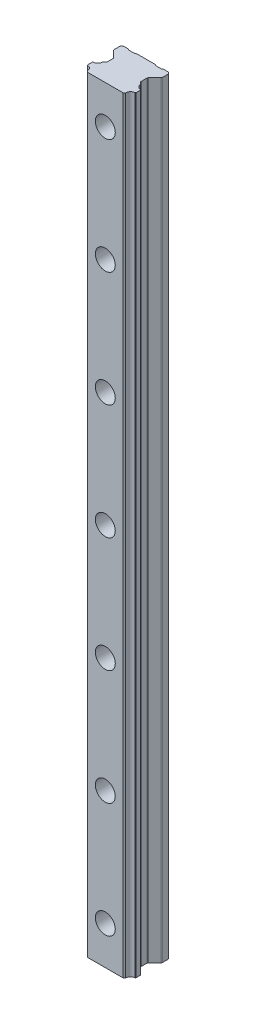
ISO-10303-21;
HEADER;
FILE_DESCRIPTION(('STEP AP214'),'2;1');
FILE_NAME('part.step','',(''),(''),'','','');
FILE_SCHEMA(('AUTOMOTIVE_DESIGN { 1 0 10303 214 1 1 1 1 }'));
ENDSEC;
DATA;
#1=APPLICATION_CONTEXT('core data for automotive mechanical design processes');
#2=APPLICATION_PROTOCOL_DEFINITION('international standard','automotive_design',2000,#1);
#3=PRODUCT_CONTEXT('',#1,'mechanical');
#4=PRODUCT('Part','Part','',(#3));
#5=PRODUCT_RELATED_PRODUCT_CATEGORY('part','',(#4));
#6=PRODUCT_DEFINITION_FORMATION('','',#4);
#7=PRODUCT_DEFINITION_CONTEXT('part definition',#1,'design');
#8=PRODUCT_DEFINITION('design','',#6,#7);
#9=PRODUCT_DEFINITION_SHAPE('','',#8);
#10=(LENGTH_UNIT() NAMED_UNIT(*) SI_UNIT(.MILLI.,.METRE.));
#11=(NAMED_UNIT(*) PLANE_ANGLE_UNIT() SI_UNIT($,.RADIAN.));
#12=(NAMED_UNIT(*) SI_UNIT($,.STERADIAN.) SOLID_ANGLE_UNIT());
#13=UNCERTAINTY_MEASURE_WITH_UNIT(LENGTH_MEASURE(1.E-05),#10,'distance_accuracy_value','');
#14=(GEOMETRIC_REPRESENTATION_CONTEXT(3) GLOBAL_UNCERTAINTY_ASSIGNED_CONTEXT((#13)) GLOBAL_UNIT_ASSIGNED_CONTEXT((#10,
#11,#12)) REPRESENTATION_CONTEXT('',''));
#15=CARTESIAN_POINT('',(0.,0.,0.));
#16=DIRECTION('',(0.,0.,1.));
#17=DIRECTION('',(1.,0.,0.));
#18=AXIS2_PLACEMENT_3D('',#15,#16,#17);
#19=CARTESIAN_POINT('',(0.,950.,-22.));
#20=DIRECTION('',(0.,0.,-1.));
#21=DIRECTION('',(0.,-1.,0.));
#22=AXIS2_PLACEMENT_3D('',#19,#20,#21);
#23=PLANE('',#22);
#24=CARTESIAN_POINT('',(0.,950.,-22.));
#25=DIRECTION('',(0.,0.,-1.));
#26=DIRECTION('',(0.,-1.,0.));
#27=AXIS2_PLACEMENT_3D('',#24,#25,#26);
#28=CIRCLE('',#27,9.);
#29=CARTESIAN_POINT('',(0.,941.,-22.));
#30=VERTEX_POINT('',#29);
#31=EDGE_CURVE('E11',#30,#30,#28,.T.);
#32=ORIENTED_EDGE('',*,*,#31,.T.);
#33=EDGE_LOOP('',(#32));
#34=FACE_BOUND('',#33,.T.);
#35=CARTESIAN_POINT('',(0.,950.,-22.));
#36=DIRECTION('',(0.,0.,1.));
#37=DIRECTION('',(0.,-1.,0.));
#38=AXIS2_PLACEMENT_3D('',#35,#36,#37);
#39=CIRCLE('',#38,13.);
#40=CARTESIAN_POINT('',(0.,937.,-22.));
#41=VERTEX_POINT('',#40);
#42=EDGE_CURVE('E28',#41,#41,#39,.T.);
#43=ORIENTED_EDGE('',*,*,#42,.T.);
#44=EDGE_LOOP('',(#43));
#45=FACE_BOUND('',#44,.T.);
#46=ADVANCED_FACE('F17',(#34,#45),#23,.F.);
#47=CARTESIAN_POINT('',(0.,950.,0.));
#48=DIRECTION('',(0.,0.,-1.));
#49=DIRECTION('',(0.,-1.,0.));
#50=AXIS2_PLACEMENT_3D('',#47,#48,#49);
#51=CYLINDRICAL_SURFACE('',#50,13.);
#52=ORIENTED_EDGE('',*,*,#42,.F.);
#53=EDGE_LOOP('',(#52));
#54=FACE_BOUND('',#53,.T.);
#55=CARTESIAN_POINT('',(0.,950.,0.));
#56=DIRECTION('',(0.,0.,-1.));
#57=DIRECTION('',(0.,-1.,0.));
#58=AXIS2_PLACEMENT_3D('',#55,#56,#57);
#59=CIRCLE('',#58,13.);
#60=CARTESIAN_POINT('',(0.,937.,0.));
#61=VERTEX_POINT('',#60);
#62=EDGE_CURVE('E272',#61,#61,#59,.T.);
#63=ORIENTED_EDGE('',*,*,#62,.F.);
#64=EDGE_LOOP('',(#63));
#65=FACE_BOUND('',#64,.T.);
#66=ADVANCED_FACE('F2012',(#54,#65),#51,.F.);
#67=CARTESIAN_POINT('',(0.,950.,-22.));
#68=DIRECTION('',(0.,0.,-1.));
#69=DIRECTION('',(0.,-1.,0.));
#70=AXIS2_PLACEMENT_3D('',#67,#68,#69);
#71=CYLINDRICAL_SURFACE('',#70,9.);
#72=CARTESIAN_POINT('',(0.,950.,-53.0000000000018));
#73=DIRECTION('',(0.,0.,-1.));
#74=DIRECTION('',(-1.,0.,0.));
#75=AXIS2_PLACEMENT_3D('',#72,#73,#74);
#76=CIRCLE('',#75,9.);
#77=CARTESIAN_POINT('',(-9.,950.,-53.0000000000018));
#78=VERTEX_POINT('',#77);
#79=EDGE_CURVE('E263',#78,#78,#76,.T.);
#80=ORIENTED_EDGE('',*,*,#79,.T.);
#81=EDGE_LOOP('',(#80));
#82=FACE_BOUND('',#81,.T.);
#83=ORIENTED_EDGE('',*,*,#31,.F.);
#84=EDGE_LOOP('',(#83));
#85=FACE_BOUND('',#84,.T.);
#86=ADVANCED_FACE('F2003',(#82,#85),#71,.F.);
#87=CARTESIAN_POINT('',(0.,800.,-22.));
#88=DIRECTION('',(0.,0.,-1.));
#89=DIRECTION('',(0.,-1.,0.));
#90=AXIS2_PLACEMENT_3D('',#87,#88,#89);
#91=PLANE('',#90);
#92=CARTESIAN_POINT('',(0.,800.,-22.));
#93=DIRECTION('',(0.,0.,-1.));
#94=DIRECTION('',(0.,-1.,0.));
#95=AXIS2_PLACEMENT_3D('',#92,#93,#94);
#96=CIRCLE('',#95,9.);
#97=CARTESIAN_POINT('',(0.,791.,-22.));
#98=VERTEX_POINT('',#97);
#99=EDGE_CURVE('E639',#98,#98,#96,.T.);
#100=ORIENTED_EDGE('',*,*,#99,.T.);
#101=EDGE_LOOP('',(#100));
#102=FACE_BOUND('',#101,.T.);
#103=CARTESIAN_POINT('',(0.,800.,-22.));
#104=DIRECTION('',(0.,0.,1.));
#105=DIRECTION('',(0.,-1.,0.));
#106=AXIS2_PLACEMENT_3D('',#103,#104,#105);
#107=CIRCLE('',#106,13.);
#108=CARTESIAN_POINT('',(0.,787.,-22.));
#109=VERTEX_POINT('',#108);
#110=EDGE_CURVE('E635',#109,#109,#107,.T.);
#111=ORIENTED_EDGE('',*,*,#110,.T.);
#112=EDGE_LOOP('',(#111));
#113=FACE_BOUND('',#112,.T.);
#114=ADVANCED_FACE('F1994',(#102,#113),#91,.F.);
#115=CARTESIAN_POINT('',(0.,800.,0.));
#116=DIRECTION('',(0.,0.,-1.));
#117=DIRECTION('',(0.,-1.,0.));
#118=AXIS2_PLACEMENT_3D('',#115,#116,#117);
#119=CYLINDRICAL_SURFACE('',#118,13.);
#120=ORIENTED_EDGE('',*,*,#110,.F.);
#121=EDGE_LOOP('',(#120));
#122=FACE_BOUND('',#121,.T.);
#123=CARTESIAN_POINT('',(0.,800.,0.));
#124=DIRECTION('',(0.,0.,-1.));
#125=DIRECTION('',(0.,-1.,0.));
#126=AXIS2_PLACEMENT_3D('',#123,#124,#125);
#127=CIRCLE('',#126,13.);
#128=CARTESIAN_POINT('',(0.,787.,0.));
#129=VERTEX_POINT('',#128);
#130=EDGE_CURVE('E447',#129,#129,#127,.T.);
#131=ORIENTED_EDGE('',*,*,#130,.F.);
#132=EDGE_LOOP('',(#131));
#133=FACE_BOUND('',#132,.T.);
#134=ADVANCED_FACE('F1985',(#122,#133),#119,.F.);
#135=CARTESIAN_POINT('',(0.,800.,-22.));
#136=DIRECTION('',(0.,0.,-1.));
#137=DIRECTION('',(0.,-1.,0.));
#138=AXIS2_PLACEMENT_3D('',#135,#136,#137);
#139=CYLINDRICAL_SURFACE('',#138,9.);
#140=CARTESIAN_POINT('',(0.,800.,-53.0000000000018));
#141=DIRECTION('',(0.,0.,-1.));
#142=DIRECTION('',(-1.,0.,0.));
#143=AXIS2_PLACEMENT_3D('',#140,#141,#142);
#144=CIRCLE('',#143,9.);
#145=CARTESIAN_POINT('',(-9.,800.,-53.0000000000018));
#146=VERTEX_POINT('',#145);
#147=EDGE_CURVE('E640',#146,#146,#144,.T.);
#148=ORIENTED_EDGE('',*,*,#147,.T.);
#149=EDGE_LOOP('',(#148));
#150=FACE_BOUND('',#149,.T.);
#151=ORIENTED_EDGE('',*,*,#99,.F.);
#152=EDGE_LOOP('',(#151));
#153=FACE_BOUND('',#152,.T.);
#154=ADVANCED_FACE('F1976',(#150,#153),#139,.F.);
#155=CARTESIAN_POINT('',(0.,650.,-22.));
#156=DIRECTION('',(0.,0.,-1.));
#157=DIRECTION('',(0.,-1.,0.));
#158=AXIS2_PLACEMENT_3D('',#155,#156,#157);
#159=PLANE('',#158);
#160=CARTESIAN_POINT('',(0.,650.,-22.));
#161=DIRECTION('',(0.,0.,-1.));
#162=DIRECTION('',(0.,-1.,0.));
#163=AXIS2_PLACEMENT_3D('',#160,#161,#162);
#164=CIRCLE('',#163,9.);
#165=CARTESIAN_POINT('',(0.,641.,-22.));
#166=VERTEX_POINT('',#165);
#167=EDGE_CURVE('E474',#166,#166,#164,.T.);
#168=ORIENTED_EDGE('',*,*,#167,.T.);
#169=EDGE_LOOP('',(#168));
#170=FACE_BOUND('',#169,.T.);
#171=CARTESIAN_POINT('',(0.,650.,-22.));
#172=DIRECTION('',(0.,0.,1.));
#173=DIRECTION('',(0.,-1.,0.));
#174=AXIS2_PLACEMENT_3D('',#171,#172,#173);
#175=CIRCLE('',#174,13.);
#176=CARTESIAN_POINT('',(0.,637.,-22.));
#177=VERTEX_POINT('',#176);
#178=EDGE_CURVE('E470',#177,#177,#175,.T.);
#179=ORIENTED_EDGE('',*,*,#178,.T.);
#180=EDGE_LOOP('',(#179));
#181=FACE_BOUND('',#180,.T.);
#182=ADVANCED_FACE('F1967',(#170,#181),#159,.F.);
#183=CARTESIAN_POINT('',(0.,650.,0.));
#184=DIRECTION('',(0.,0.,-1.));
#185=DIRECTION('',(0.,-1.,0.));
#186=AXIS2_PLACEMENT_3D('',#183,#184,#185);
#187=CYLINDRICAL_SURFACE('',#186,13.);
#188=ORIENTED_EDGE('',*,*,#178,.F.);
#189=EDGE_LOOP('',(#188));
#190=FACE_BOUND('',#189,.T.);
#191=CARTESIAN_POINT('',(0.,650.,0.));
#192=DIRECTION('',(0.,0.,-1.));
#193=DIRECTION('',(0.,-1.,0.));
#194=AXIS2_PLACEMENT_3D('',#191,#192,#193);
#195=CIRCLE('',#194,13.);
#196=CARTESIAN_POINT('',(0.,637.,0.));
#197=VERTEX_POINT('',#196);
#198=EDGE_CURVE('E443',#197,#197,#195,.T.);
#199=ORIENTED_EDGE('',*,*,#198,.F.);
#200=EDGE_LOOP('',(#199));
#201=FACE_BOUND('',#200,.T.);
#202=ADVANCED_FACE('F1958',(#190,#201),#187,.F.);
#203=CARTESIAN_POINT('',(0.,650.,-22.));
#204=DIRECTION('',(0.,0.,-1.));
#205=DIRECTION('',(0.,-1.,0.));
#206=AXIS2_PLACEMENT_3D('',#203,#204,#205);
#207=CYLINDRICAL_SURFACE('',#206,9.);
#208=CARTESIAN_POINT('',(0.,650.,-53.0000000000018));
#209=DIRECTION('',(0.,0.,-1.));
#210=DIRECTION('',(-1.,0.,0.));
#211=AXIS2_PLACEMENT_3D('',#208,#209,#210);
#212=CIRCLE('',#211,9.);
#213=CARTESIAN_POINT('',(-9.,650.,-53.0000000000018));
#214=VERTEX_POINT('',#213);
#215=EDGE_CURVE('E475',#214,#214,#212,.T.);
#216=ORIENTED_EDGE('',*,*,#215,.T.);
#217=EDGE_LOOP('',(#216));
#218=FACE_BOUND('',#217,.T.);
#219=ORIENTED_EDGE('',*,*,#167,.F.);
#220=EDGE_LOOP('',(#219));
#221=FACE_BOUND('',#220,.T.);
#222=ADVANCED_FACE('F1949',(#218,#221),#207,.F.);
#223=CARTESIAN_POINT('',(0.,500.,-22.));
#224=DIRECTION('',(0.,0.,-1.));
#225=DIRECTION('',(0.,-1.,0.));
#226=AXIS2_PLACEMENT_3D('',#223,#224,#225);
#227=PLANE('',#226);
#228=CARTESIAN_POINT('',(0.,500.,-22.));
#229=DIRECTION('',(0.,0.,-1.));
#230=DIRECTION('',(0.,-1.,0.));
#231=AXIS2_PLACEMENT_3D('',#228,#229,#230);
#232=CIRCLE('',#231,9.);
#233=CARTESIAN_POINT('',(0.,491.,-22.));
#234=VERTEX_POINT('',#233);
#235=EDGE_CURVE('E786',#234,#234,#232,.T.);
#236=ORIENTED_EDGE('',*,*,#235,.T.);
#237=EDGE_LOOP('',(#236));
#238=FACE_BOUND('',#237,.T.);
#239=CARTESIAN_POINT('',(0.,500.,-22.));
#240=DIRECTION('',(0.,0.,1.));
#241=DIRECTION('',(0.,-1.,0.));
#242=AXIS2_PLACEMENT_3D('',#239,#240,#241);
#243=CIRCLE('',#242,13.);
#244=CARTESIAN_POINT('',(0.,487.,-22.));
#245=VERTEX_POINT('',#244);
#246=EDGE_CURVE('E790',#245,#245,#243,.T.);
#247=ORIENTED_EDGE('',*,*,#246,.T.);
#248=EDGE_LOOP('',(#247));
#249=FACE_BOUND('',#248,.T.);
#250=ADVANCED_FACE('F1940',(#238,#249),#227,.F.);
#251=CARTESIAN_POINT('',(0.,500.,0.));
#252=DIRECTION('',(0.,0.,-1.));
#253=DIRECTION('',(0.,-1.,0.));
#254=AXIS2_PLACEMENT_3D('',#251,#252,#253);
#255=CYLINDRICAL_SURFACE('',#254,13.);
#256=ORIENTED_EDGE('',*,*,#246,.F.);
#257=EDGE_LOOP('',(#256));
#258=FACE_BOUND('',#257,.T.);
#259=CARTESIAN_POINT('',(0.,500.,0.));
#260=DIRECTION('',(0.,0.,-1.));
#261=DIRECTION('',(0.,-1.,0.));
#262=AXIS2_PLACEMENT_3D('',#259,#260,#261);
#263=CIRCLE('',#262,13.);
#264=CARTESIAN_POINT('',(0.,487.,0.));
#265=VERTEX_POINT('',#264);
#266=EDGE_CURVE('E441',#265,#265,#263,.T.);
#267=ORIENTED_EDGE('',*,*,#266,.F.);
#268=EDGE_LOOP('',(#267));
#269=FACE_BOUND('',#268,.T.);
#270=ADVANCED_FACE('F1931',(#258,#269),#255,.F.);
#271=CARTESIAN_POINT('',(0.,500.,-22.));
#272=DIRECTION('',(0.,0.,-1.));
#273=DIRECTION('',(0.,-1.,0.));
#274=AXIS2_PLACEMENT_3D('',#271,#272,#273);
#275=CYLINDRICAL_SURFACE('',#274,9.);
#276=CARTESIAN_POINT('',(0.,500.,-53.0000000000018));
#277=DIRECTION('',(0.,0.,-1.));
#278=DIRECTION('',(-1.,0.,0.));
#279=AXIS2_PLACEMENT_3D('',#276,#277,#278);
#280=CIRCLE('',#279,9.);
#281=CARTESIAN_POINT('',(-9.,500.,-53.0000000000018));
#282=VERTEX_POINT('',#281);
#283=EDGE_CURVE('E794',#282,#282,#280,.T.);
#284=ORIENTED_EDGE('',*,*,#283,.T.);
#285=EDGE_LOOP('',(#284));
#286=FACE_BOUND('',#285,.T.);
#287=ORIENTED_EDGE('',*,*,#235,.F.);
#288=EDGE_LOOP('',(#287));
#289=FACE_BOUND('',#288,.T.);
#290=ADVANCED_FACE('F1922',(#286,#289),#275,.F.);
#291=CARTESIAN_POINT('',(0.,350.,-22.));
#292=DIRECTION('',(0.,0.,-1.));
#293=DIRECTION('',(0.,-1.,0.));
#294=AXIS2_PLACEMENT_3D('',#291,#292,#293);
#295=PLANE('',#294);
#296=CARTESIAN_POINT('',(0.,350.,-22.));
#297=DIRECTION('',(0.,0.,-1.));
#298=DIRECTION('',(0.,-1.,0.));
#299=AXIS2_PLACEMENT_3D('',#296,#297,#298);
#300=CIRCLE('',#299,9.);
#301=CARTESIAN_POINT('',(0.,341.,-22.));
#302=VERTEX_POINT('',#301);
#303=EDGE_CURVE('E753',#302,#302,#300,.T.);
#304=ORIENTED_EDGE('',*,*,#303,.T.);
#305=EDGE_LOOP('',(#304));
#306=FACE_BOUND('',#305,.T.);
#307=CARTESIAN_POINT('',(0.,350.,-22.));
#308=DIRECTION('',(0.,0.,1.));
#309=DIRECTION('',(0.,-1.,0.));
#310=AXIS2_PLACEMENT_3D('',#307,#308,#309);
#311=CIRCLE('',#310,13.);
#312=CARTESIAN_POINT('',(0.,337.,-22.));
#313=VERTEX_POINT('',#312);
#314=EDGE_CURVE('E749',#313,#313,#311,.T.);
#315=ORIENTED_EDGE('',*,*,#314,.T.);
#316=EDGE_LOOP('',(#315));
#317=FACE_BOUND('',#316,.T.);
#318=ADVANCED_FACE('F1913',(#306,#317),#295,.F.);
#319=CARTESIAN_POINT('',(0.,350.,0.));
#320=DIRECTION('',(0.,0.,-1.));
#321=DIRECTION('',(0.,-1.,0.));
#322=AXIS2_PLACEMENT_3D('',#319,#320,#321);
#323=CYLINDRICAL_SURFACE('',#322,13.);
#324=ORIENTED_EDGE('',*,*,#314,.F.);
#325=EDGE_LOOP('',(#324));
#326=FACE_BOUND('',#325,.T.);
#327=CARTESIAN_POINT('',(0.,350.,0.));
#328=DIRECTION('',(0.,0.,-1.));
#329=DIRECTION('',(0.,-1.,0.));
#330=AXIS2_PLACEMENT_3D('',#327,#328,#329);
#331=CIRCLE('',#330,13.);
#332=CARTESIAN_POINT('',(0.,337.,0.));
#333=VERTEX_POINT('',#332);
#334=EDGE_CURVE('E437',#333,#333,#331,.T.);
#335=ORIENTED_EDGE('',*,*,#334,.F.);
#336=EDGE_LOOP('',(#335));
#337=FACE_BOUND('',#336,.T.);
#338=ADVANCED_FACE('F1904',(#326,#337),#323,.F.);
#339=CARTESIAN_POINT('',(0.,350.,-22.));
#340=DIRECTION('',(0.,0.,-1.));
#341=DIRECTION('',(0.,-1.,0.));
#342=AXIS2_PLACEMENT_3D('',#339,#340,#341);
#343=CYLINDRICAL_SURFACE('',#342,9.);
#344=CARTESIAN_POINT('',(0.,350.,-53.0000000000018));
#345=DIRECTION('',(0.,0.,-1.));
#346=DIRECTION('',(-1.,0.,0.));
#347=AXIS2_PLACEMENT_3D('',#344,#345,#346);
#348=CIRCLE('',#347,9.);
#349=CARTESIAN_POINT('',(-9.,350.,-53.0000000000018));
#350=VERTEX_POINT('',#349);
#351=EDGE_CURVE('E754',#350,#350,#348,.T.);
#352=ORIENTED_EDGE('',*,*,#351,.T.);
#353=EDGE_LOOP('',(#352));
#354=FACE_BOUND('',#353,.T.);
#355=ORIENTED_EDGE('',*,*,#303,.F.);
#356=EDGE_LOOP('',(#355));
#357=FACE_BOUND('',#356,.T.);
#358=ADVANCED_FACE('F1895',(#354,#357),#343,.F.);
#359=CARTESIAN_POINT('',(0.,200.,-22.));
#360=DIRECTION('',(0.,0.,-1.));
#361=DIRECTION('',(0.,-1.,0.));
#362=AXIS2_PLACEMENT_3D('',#359,#360,#361);
#363=PLANE('',#362);
#364=CARTESIAN_POINT('',(0.,200.,-22.));
#365=DIRECTION('',(0.,0.,-1.));
#366=DIRECTION('',(0.,-1.,0.));
#367=AXIS2_PLACEMENT_3D('',#364,#365,#366);
#368=CIRCLE('',#367,9.);
#369=CARTESIAN_POINT('',(0.,191.,-22.));
#370=VERTEX_POINT('',#369);
#371=EDGE_CURVE('E584',#370,#370,#368,.T.);
#372=ORIENTED_EDGE('',*,*,#371,.T.);
#373=EDGE_LOOP('',(#372));
#374=FACE_BOUND('',#373,.T.);
#375=CARTESIAN_POINT('',(0.,200.,-22.));
#376=DIRECTION('',(0.,0.,1.));
#377=DIRECTION('',(0.,-1.,0.));
#378=AXIS2_PLACEMENT_3D('',#375,#376,#377);
#379=CIRCLE('',#378,13.);
#380=CARTESIAN_POINT('',(0.,187.,-22.));
#381=VERTEX_POINT('',#380);
#382=EDGE_CURVE('E580',#381,#381,#379,.T.);
#383=ORIENTED_EDGE('',*,*,#382,.T.);
#384=EDGE_LOOP('',(#383));
#385=FACE_BOUND('',#384,.T.);
#386=ADVANCED_FACE('F1885',(#374,#385),#363,.F.);
#387=CARTESIAN_POINT('',(0.,200.,0.));
#388=DIRECTION('',(0.,0.,-1.));
#389=DIRECTION('',(0.,-1.,0.));
#390=AXIS2_PLACEMENT_3D('',#387,#388,#389);
#391=CYLINDRICAL_SURFACE('',#390,13.);
#392=ORIENTED_EDGE('',*,*,#382,.F.);
#393=EDGE_LOOP('',(#392));
#394=FACE_BOUND('',#393,.T.);
#395=CARTESIAN_POINT('',(0.,200.,0.));
#396=DIRECTION('',(0.,0.,-1.));
#397=DIRECTION('',(0.,-1.,0.));
#398=AXIS2_PLACEMENT_3D('',#395,#396,#397);
#399=CIRCLE('',#398,13.);
#400=CARTESIAN_POINT('',(0.,187.,0.));
#401=VERTEX_POINT('',#400);
#402=EDGE_CURVE('E442',#401,#401,#399,.T.);
#403=ORIENTED_EDGE('',*,*,#402,.F.);
#404=EDGE_LOOP('',(#403));
#405=FACE_BOUND('',#404,.T.);
#406=ADVANCED_FACE('F1876',(#394,#405),#391,.F.);
#407=CARTESIAN_POINT('',(0.,200.,-22.));
#408=DIRECTION('',(0.,0.,-1.));
#409=DIRECTION('',(0.,-1.,0.));
#410=AXIS2_PLACEMENT_3D('',#407,#408,#409);
#411=CYLINDRICAL_SURFACE('',#410,9.);
#412=CARTESIAN_POINT('',(0.,200.,-53.0000000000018));
#413=DIRECTION('',(0.,0.,-1.));
#414=DIRECTION('',(-1.,0.,0.));
#415=AXIS2_PLACEMENT_3D('',#412,#413,#414);
#416=CIRCLE('',#415,9.);
#417=CARTESIAN_POINT('',(-9.,200.,-53.0000000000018));
#418=VERTEX_POINT('',#417);
#419=EDGE_CURVE('E585',#418,#418,#416,.T.);
#420=ORIENTED_EDGE('',*,*,#419,.T.);
#421=EDGE_LOOP('',(#420));
#422=FACE_BOUND('',#421,.T.);
#423=ORIENTED_EDGE('',*,*,#371,.F.);
#424=EDGE_LOOP('',(#423));
#425=FACE_BOUND('',#424,.T.);
#426=ADVANCED_FACE('F1867',(#422,#425),#411,.F.);
#427=CARTESIAN_POINT('',(-32.5,1000.,0.));
#428=DIRECTION('',(0.,0.,-1.));
#429=DIRECTION('',(0.,-1.,0.));
#430=AXIS2_PLACEMENT_3D('',#427,#428,#429);
#431=PLANE('',#430);
#432=ORIENTED_EDGE('',*,*,#62,.T.);
#433=EDGE_LOOP('',(#432));
#434=FACE_BOUND('',#433,.T.);
#435=ORIENTED_EDGE('',*,*,#130,.T.);
#436=EDGE_LOOP('',(#435));
#437=FACE_BOUND('',#436,.T.);
#438=ORIENTED_EDGE('',*,*,#198,.T.);
#439=EDGE_LOOP('',(#438));
#440=FACE_BOUND('',#439,.T.);
#441=ORIENTED_EDGE('',*,*,#266,.T.);
#442=EDGE_LOOP('',(#441));
#443=FACE_BOUND('',#442,.T.);
#444=ORIENTED_EDGE('',*,*,#334,.T.);
#445=EDGE_LOOP('',(#444));
#446=FACE_BOUND('',#445,.T.);
#447=ORIENTED_EDGE('',*,*,#402,.T.);
#448=EDGE_LOOP('',(#447));
#449=FACE_BOUND('',#448,.T.);
#450=CARTESIAN_POINT('',(0.,50.,0.));
#451=DIRECTION('',(0.,0.,-1.));
#452=DIRECTION('',(0.,-1.,0.));
#453=AXIS2_PLACEMENT_3D('',#450,#451,#452);
#454=CIRCLE('',#453,13.);
#455=CARTESIAN_POINT('',(0.,37.,0.));
#456=VERTEX_POINT('',#455);
#457=EDGE_CURVE('E930',#456,#456,#454,.T.);
#458=ORIENTED_EDGE('',*,*,#457,.T.);
#459=EDGE_LOOP('',(#458));
#460=FACE_BOUND('',#459,.T.);
#461=DIRECTION('',(0.,-1.,0.));
#462=VECTOR('',#461,1.);
#463=CARTESIAN_POINT('',(-23.3379504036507,1003.61845339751,-1.73472347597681E-13));
#464=LINE('',#463,#462);
#465=CARTESIAN_POINT('',(-23.3379504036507,1000.,-1.73472347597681E-13));
#466=VERTEX_POINT('',#465);
#467=CARTESIAN_POINT('',(-23.3379504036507,0.,0.));
#468=VERTEX_POINT('',#467);
#469=EDGE_CURVE('E722',#466,#468,#464,.T.);
#470=ORIENTED_EDGE('',*,*,#469,.T.);
#471=DIRECTION('',(1.,0.,0.));
#472=VECTOR('',#471,1.);
#473=CARTESIAN_POINT('',(-32.5,0.,0.));
#474=LINE('',#473,#472);
#475=CARTESIAN_POINT('',(23.3379504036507,0.,1.80628081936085E-13));
#476=VERTEX_POINT('',#475);
#477=EDGE_CURVE('E490',#468,#476,#474,.T.);
#478=ORIENTED_EDGE('',*,*,#477,.T.);
#479=DIRECTION('',(0.,-1.,0.));
#480=VECTOR('',#479,1.);
#481=CARTESIAN_POINT('',(23.3379504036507,1003.61845339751,1.80628081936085E-13));
#482=LINE('',#481,#480);
#483=CARTESIAN_POINT('',(23.3379504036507,1000.,1.80628081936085E-13));
#484=VERTEX_POINT('',#483);
#485=EDGE_CURVE('E629',#484,#476,#482,.T.);
#486=ORIENTED_EDGE('',*,*,#485,.F.);
#487=DIRECTION('',(1.,0.,0.));
#488=VECTOR('',#487,1.);
#489=CARTESIAN_POINT('',(-32.5,1000.,0.));
#490=LINE('',#489,#488);
#491=EDGE_CURVE('E496',#466,#484,#490,.T.);
#492=ORIENTED_EDGE('',*,*,#491,.F.);
#493=EDGE_LOOP('',(#470,#478,#486,#492));
#494=FACE_BOUND('',#493,.T.);
#495=ADVANCED_FACE('F970',(#434,#437,#440,#443,#446,#449,#460,#494),#431,.F.);
#496=CARTESIAN_POINT('',(0.,1000.,0.));
#497=DIRECTION('',(0.,1.,0.));
#498=DIRECTION('',(1.,0.,0.));
#499=AXIS2_PLACEMENT_3D('',#496,#497,#498);
#500=PLANE('',#499);
#501=CARTESIAN_POINT('',(-30.9900221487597,1000.,-1.87599085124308));
#502=DIRECTION('',(0.,-1.,0.));
#503=DIRECTION('',(0.,0.,1.));
#504=AXIS2_PLACEMENT_3D('',#501,#502,#503);
#505=CIRCLE('',#504,6.);
#506=CARTESIAN_POINT('',(-30.9080637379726,1000.,-7.87543106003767));
#507=VERTEX_POINT('',#506);
#508=CARTESIAN_POINT('',(-24.9940527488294,1000.,-1.65610234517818));
#509=VERTEX_POINT('',#508);
#510=EDGE_CURVE('E487',#507,#509,#505,.T.);
#511=ORIENTED_EDGE('',*,*,#510,.T.);
#512=DIRECTION('',(0.707106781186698,0.,0.707106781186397));
#513=VECTOR('',#512,1.);
#514=CARTESIAN_POINT('',(-11.6689752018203,1000.,11.6689752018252));
#515=LINE('',#514,#513);
#516=EDGE_CURVE('E491',#509,#466,#515,.T.);
#517=ORIENTED_EDGE('',*,*,#516,.T.);
#518=ORIENTED_EDGE('',*,*,#491,.T.);
#519=DIRECTION('',(0.707106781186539,0.,-0.707106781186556));
#520=VECTOR('',#519,1.);
#521=CARTESIAN_POINT('',(11.6689752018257,1000.,11.6689752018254));
#522=LINE('',#521,#520);
#523=CARTESIAN_POINT('',(24.9940527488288,1000.,-1.65610234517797));
#524=VERTEX_POINT('',#523);
#525=EDGE_CURVE('E500',#484,#524,#522,.T.);
#526=ORIENTED_EDGE('',*,*,#525,.T.);
#527=CARTESIAN_POINT('',(30.990022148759,1000.,-1.87599085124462));
#528=DIRECTION('',(0.,-1.,0.));
#529=DIRECTION('',(0.,0.,1.));
#530=AXIS2_PLACEMENT_3D('',#527,#528,#529);
#531=CIRCLE('',#530,6.);
#532=CARTESIAN_POINT('',(30.9080637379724,1000.,-7.87543106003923));
#533=VERTEX_POINT('',#532);
#534=EDGE_CURVE('E515',#524,#533,#531,.T.);
#535=ORIENTED_EDGE('',*,*,#534,.T.);
#536=DIRECTION('',(0.707106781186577,0.,-0.707106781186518));
#537=VECTOR('',#536,1.);
#538=CARTESIAN_POINT('',(11.5163163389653,1000.,11.5163163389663));
#539=LINE('',#538,#537);
#540=CARTESIAN_POINT('',(31.4999999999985,1000.,-8.46736732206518));
#541=VERTEX_POINT('',#540);
#542=EDGE_CURVE('E511',#533,#541,#539,.T.);
#543=ORIENTED_EDGE('',*,*,#542,.T.);
#544=DIRECTION('',(0.,0.,-1.));
#545=VECTOR('',#544,1.);
#546=CARTESIAN_POINT('',(31.4999999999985,1000.,0.));
#547=LINE('',#546,#545);
#548=CARTESIAN_POINT('',(31.4999999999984,1000.,-14.5777938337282));
#549=VERTEX_POINT('',#548);
#550=EDGE_CURVE('E516',#541,#549,#547,.T.);
#551=ORIENTED_EDGE('',*,*,#550,.T.);
#552=DIRECTION('',(-0.764649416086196,0.,-0.644446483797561));
#553=VECTOR('',#552,1.);
#554=CARTESIAN_POINT('',(20.2658865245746,1000.,-24.0459040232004));
#555=LINE('',#554,#553);
#556=CARTESIAN_POINT('',(30.8511549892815,1000.,-15.1246403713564));
#557=VERTEX_POINT('',#556);
#558=EDGE_CURVE('E590',#549,#557,#555,.T.);
#559=ORIENTED_EDGE('',*,*,#558,.T.);
#560=CARTESIAN_POINT('',(30.9900221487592,1000.,-21.1230331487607));
#561=DIRECTION('',(0.,-1.,0.));
#562=DIRECTION('',(0.,0.,1.));
#563=AXIS2_PLACEMENT_3D('',#560,#561,#562);
#564=CIRCLE('',#563,5.9999999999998);
#565=CARTESIAN_POINT('',(24.9911078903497,1000.,-21.0088941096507));
#566=VERTEX_POINT('',#565);
#567=EDGE_CURVE('E586',#557,#566,#564,.T.);
#568=ORIENTED_EDGE('',*,*,#567,.T.);
#569=DIRECTION('',(-0.707106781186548,0.,-0.707106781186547));
#570=VECTOR('',#569,1.);
#571=CARTESIAN_POINT('',(23.0000010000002,1000.,-23.0000010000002));
#572=LINE('',#571,#570);
#573=CARTESIAN_POINT('',(22.5393398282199,1000.,-23.4606621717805));
#574=VERTEX_POINT('',#573);
#575=EDGE_CURVE('E591',#566,#574,#572,.T.);
#576=ORIENTED_EDGE('',*,*,#575,.T.);
#577=CARTESIAN_POINT('',(23.5999999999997,1000.,-24.5213223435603));
#578=DIRECTION('',(0.,-1.,0.));
#579=DIRECTION('',(0.,0.,1.));
#580=AXIS2_PLACEMENT_3D('',#577,#578,#579);
#581=CIRCLE('',#580,1.5);
#582=CARTESIAN_POINT('',(22.0999999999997,1000.,-24.5213223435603));
#583=VERTEX_POINT('',#582);
#584=EDGE_CURVE('E772',#574,#583,#581,.T.);
#585=ORIENTED_EDGE('',*,*,#584,.T.);
#586=DIRECTION('',(0.,0.,-1.));
#587=VECTOR('',#586,1.);
#588=CARTESIAN_POINT('',(22.0999999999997,1000.,0.));
#589=LINE('',#588,#587);
#590=CARTESIAN_POINT('',(22.0999999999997,1000.,-32.3372583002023));
#591=VERTEX_POINT('',#590);
#592=EDGE_CURVE('E817',#583,#591,#589,.T.);
#593=ORIENTED_EDGE('',*,*,#592,.T.);
#594=CARTESIAN_POINT('',(23.5999999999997,1000.,-32.3372583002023));
#595=DIRECTION('',(0.,-1.,0.));
#596=DIRECTION('',(0.,0.,1.));
#597=AXIS2_PLACEMENT_3D('',#594,#595,#596);
#598=CIRCLE('',#597,1.5);
#599=CARTESIAN_POINT('',(22.5393398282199,1000.,-33.3979184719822));
#600=VERTEX_POINT('',#599);
#601=EDGE_CURVE('E813',#591,#600,#598,.T.);
#602=ORIENTED_EDGE('',*,*,#601,.T.);
#603=DIRECTION('',(0.707106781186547,0.,-0.707106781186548));
#604=VECTOR('',#603,1.);
#605=CARTESIAN_POINT('',(-5.42928932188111,1000.,-5.4292893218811));
#606=LINE('',#605,#604);
#607=CARTESIAN_POINT('',(31.0606601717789,1000.,-41.9192388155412));
#608=VERTEX_POINT('',#607);
#609=EDGE_CURVE('E468',#600,#608,#606,.T.);
#610=ORIENTED_EDGE('',*,*,#609,.T.);
#611=CARTESIAN_POINT('',(29.9999999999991,1000.,-42.979898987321));
#612=DIRECTION('',(0.,1.,0.));
#613=DIRECTION('',(0.,0.,1.));
#614=AXIS2_PLACEMENT_3D('',#611,#612,#613);
#615=CIRCLE('',#614,1.5);
#616=CARTESIAN_POINT('',(31.4999999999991,1000.,-42.979898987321));
#617=VERTEX_POINT('',#616);
#618=EDGE_CURVE('E464',#608,#617,#615,.T.);
#619=ORIENTED_EDGE('',*,*,#618,.T.);
#620=DIRECTION('',(0.,0.,-1.));
#621=VECTOR('',#620,1.);
#622=CARTESIAN_POINT('',(31.4999999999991,1000.,0.));
#623=LINE('',#622,#621);
#624=CARTESIAN_POINT('',(31.4999999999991,1000.,-51.0471087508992));
#625=VERTEX_POINT('',#624);
#626=EDGE_CURVE('E469',#617,#625,#623,.T.);
#627=ORIENTED_EDGE('',*,*,#626,.T.);
#628=DIRECTION('',(-0.707106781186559,0.,-0.707106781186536));
#629=VECTOR('',#628,1.);
#630=CARTESIAN_POINT('',(41.2735543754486,1000.,-41.27355437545));
#631=LINE('',#630,#629);
#632=CARTESIAN_POINT('',(29.5471087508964,1000.,-53.0000000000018));
#633=VERTEX_POINT('',#632);
#634=EDGE_CURVE('E735',#625,#633,#631,.T.);
#635=ORIENTED_EDGE('',*,*,#634,.T.);
#636=DIRECTION('',(-1.,0.,0.));
#637=VECTOR('',#636,1.);
#638=CARTESIAN_POINT('',(0.,1000.,-53.0000000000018));
#639=LINE('',#638,#637);
#640=CARTESIAN_POINT('',(22.5,1000.,-53.0000000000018));
#641=VERTEX_POINT('',#640);
#642=EDGE_CURVE('E436',#633,#641,#639,.T.);
#643=ORIENTED_EDGE('',*,*,#642,.T.);
#644=DIRECTION('',(-0.707102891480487,0.,0.707110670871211));
#645=VECTOR('',#644,1.);
#646=CARTESIAN_POINT('',(-15.2498762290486,1000.,-15.2497084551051));
#647=LINE('',#646,#645);
#648=CARTESIAN_POINT('',(21.5000110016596,1000.,-52.0000000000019));
#649=VERTEX_POINT('',#648);
#650=EDGE_CURVE('E403',#641,#649,#647,.T.);
#651=ORIENTED_EDGE('',*,*,#650,.T.);
#652=DIRECTION('',(-1.,0.,0.));
#653=VECTOR('',#652,1.);
#654=CARTESIAN_POINT('',(0.,1000.,-52.0000000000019));
#655=LINE('',#654,#653);
#656=CARTESIAN_POINT('',(13.5000014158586,1000.,-52.0000000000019));
#657=VERTEX_POINT('',#656);
#658=EDGE_CURVE('E396',#649,#657,#655,.T.);
#659=ORIENTED_EDGE('',*,*,#658,.T.);
#660=DIRECTION('',(-0.707107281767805,0.,-0.707106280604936));
#661=VECTOR('',#660,1.);
#662=CARTESIAN_POINT('',(32.749991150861,1000.,-32.7500375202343));
#663=LINE('',#662,#661);
#664=CARTESIAN_POINT('',(12.4999999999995,1000.,-53.0000000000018));
#665=VERTEX_POINT('',#664);
#666=EDGE_CURVE('E386',#657,#665,#663,.T.);
#667=ORIENTED_EDGE('',*,*,#666,.T.);
#668=DIRECTION('',(-1.,0.,0.));
#669=VECTOR('',#668,1.);
#670=CARTESIAN_POINT('',(0.,1000.,-53.0000000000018));
#671=LINE('',#670,#669);
#672=CARTESIAN_POINT('',(-12.5000000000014,1000.,-53.0000000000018));
#673=VERTEX_POINT('',#672);
#674=EDGE_CURVE('E397',#665,#673,#671,.T.);
#675=ORIENTED_EDGE('',*,*,#674,.T.);
#676=DIRECTION('',(-0.707107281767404,0.,0.707106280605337));
#677=VECTOR('',#676,1.);
#678=CARTESIAN_POINT('',(-32.749991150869,1000.,-32.7500375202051));
#679=LINE('',#678,#677);
#680=CARTESIAN_POINT('',(-13.5000014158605,1000.,-52.0000000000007));
#681=VERTEX_POINT('',#680);
#682=EDGE_CURVE('E448',#673,#681,#679,.T.);
#683=ORIENTED_EDGE('',*,*,#682,.T.);
#684=DIRECTION('',(-1.,0.,0.));
#685=VECTOR('',#684,1.);
#686=CARTESIAN_POINT('',(0.,1000.,-52.0000000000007));
#687=LINE('',#686,#685);
#688=CARTESIAN_POINT('',(-21.5000110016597,1000.,-52.0000000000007));
#689=VERTEX_POINT('',#688);
#690=EDGE_CURVE('E452',#681,#689,#687,.T.);
#691=ORIENTED_EDGE('',*,*,#690,.T.);
#692=DIRECTION('',(-0.707102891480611,0.,-0.707110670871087));
#693=VECTOR('',#692,1.);
#694=CARTESIAN_POINT('',(15.2498762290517,1000.,-15.2497084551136));
#695=LINE('',#694,#693);
#696=CARTESIAN_POINT('',(-22.5000000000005,1000.,-53.));
#697=VERTEX_POINT('',#696);
#698=EDGE_CURVE('E538',#689,#697,#695,.T.);
#699=ORIENTED_EDGE('',*,*,#698,.T.);
#700=DIRECTION('',(-1.,0.,0.));
#701=VECTOR('',#700,1.);
#702=CARTESIAN_POINT('',(-2.97460976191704E-12,1000.,-53.0000000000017));
#703=LINE('',#702,#701);
#704=CARTESIAN_POINT('',(-29.5471087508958,1000.,-53.));
#705=VERTEX_POINT('',#704);
#706=EDGE_CURVE('E542',#697,#705,#703,.T.);
#707=ORIENTED_EDGE('',*,*,#706,.T.);
#708=DIRECTION('',(-0.707106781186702,0.,0.707106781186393));
#709=VECTOR('',#708,1.);
#710=CARTESIAN_POINT('',(-41.2735543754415,1000.,-41.2735543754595));
#711=LINE('',#710,#709);
#712=CARTESIAN_POINT('',(-31.499999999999,1000.,-51.0471087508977));
#713=VERTEX_POINT('',#712);
#714=EDGE_CURVE('E567',#705,#713,#711,.T.);
#715=ORIENTED_EDGE('',*,*,#714,.T.);
#716=DIRECTION('',(0.,0.,1.));
#717=VECTOR('',#716,1.);
#718=CARTESIAN_POINT('',(-31.499999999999,1000.,0.));
#719=LINE('',#718,#717);
#720=CARTESIAN_POINT('',(-31.499999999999,1000.,-42.9798989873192));
#721=VERTEX_POINT('',#720);
#722=EDGE_CURVE('E564',#713,#721,#719,.T.);
#723=ORIENTED_EDGE('',*,*,#722,.T.);
#724=CARTESIAN_POINT('',(-29.999999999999,1000.,-42.9798989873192));
#725=DIRECTION('',(0.,1.,0.));
#726=DIRECTION('',(0.,0.,1.));
#727=AXIS2_PLACEMENT_3D('',#724,#725,#726);
#728=CIRCLE('',#727,1.5);
#729=CARTESIAN_POINT('',(-31.0606601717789,1000.,-41.9192388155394));
#730=VERTEX_POINT('',#729);
#731=EDGE_CURVE('E568',#721,#730,#728,.T.);
#732=ORIENTED_EDGE('',*,*,#731,.T.);
#733=DIRECTION('',(0.707106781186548,0.,0.707106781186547));
#734=VECTOR('',#733,1.);
#735=CARTESIAN_POINT('',(5.42928932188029,1000.,-5.4292893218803));
#736=LINE('',#735,#734);
#737=CARTESIAN_POINT('',(-22.5393398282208,1000.,-33.3979184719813));
#738=VERTEX_POINT('',#737);
#739=EDGE_CURVE('E599',#730,#738,#736,.T.);
#740=ORIENTED_EDGE('',*,*,#739,.T.);
#741=CARTESIAN_POINT('',(-23.6000000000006,1000.,-32.3372583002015));
#742=DIRECTION('',(0.,-1.,0.));
#743=DIRECTION('',(0.,0.,1.));
#744=AXIS2_PLACEMENT_3D('',#741,#742,#743);
#745=CIRCLE('',#744,1.5);
#746=CARTESIAN_POINT('',(-22.1000000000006,1000.,-32.3372583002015));
#747=VERTEX_POINT('',#746);
#748=EDGE_CURVE('E595',#738,#747,#745,.T.);
#749=ORIENTED_EDGE('',*,*,#748,.T.);
#750=DIRECTION('',(0.,0.,1.));
#751=VECTOR('',#750,1.);
#752=CARTESIAN_POINT('',(-22.1000000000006,1000.,0.));
#753=LINE('',#752,#751);
#754=CARTESIAN_POINT('',(-22.1000000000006,1000.,-24.5213223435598));
#755=VERTEX_POINT('',#754);
#756=EDGE_CURVE('E600',#747,#755,#753,.T.);
#757=ORIENTED_EDGE('',*,*,#756,.T.);
#758=CARTESIAN_POINT('',(-23.6000000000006,1000.,-24.5213223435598));
#759=DIRECTION('',(0.,-1.,0.));
#760=DIRECTION('',(0.,0.,1.));
#761=AXIS2_PLACEMENT_3D('',#758,#759,#760);
#762=CIRCLE('',#761,1.5);
#763=CARTESIAN_POINT('',(-22.5393398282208,1000.,-23.46066217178));
#764=VERTEX_POINT('',#763);
#765=EDGE_CURVE('E605',#755,#764,#762,.T.);
#766=ORIENTED_EDGE('',*,*,#765,.T.);
#767=DIRECTION('',(-0.707106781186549,0.,0.707106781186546));
#768=VECTOR('',#767,1.);
#769=CARTESIAN_POINT('',(-23.0000010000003,1000.,-23.0000010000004));
#770=LINE('',#769,#768);
#771=CARTESIAN_POINT('',(-24.9911078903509,1000.,-21.0088941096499));
#772=VERTEX_POINT('',#771);
#773=EDGE_CURVE('E601',#764,#772,#770,.T.);
#774=ORIENTED_EDGE('',*,*,#773,.T.);
#775=CARTESIAN_POINT('',(-30.9900221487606,1000.,-21.123033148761));
#776=DIRECTION('',(0.,-1.,0.));
#777=DIRECTION('',(0.,0.,1.));
#778=AXIS2_PLACEMENT_3D('',#775,#776,#777);
#779=CIRCLE('',#778,6.00000000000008);
#780=CARTESIAN_POINT('',(-30.9080637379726,1000.,-15.1235929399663));
#781=VERTEX_POINT('',#780);
#782=EDGE_CURVE('E505',#772,#781,#779,.T.);
#783=ORIENTED_EDGE('',*,*,#782,.T.);
#784=DIRECTION('',(-0.707106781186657,0.,0.707106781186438));
#785=VECTOR('',#784,1.);
#786=CARTESIAN_POINT('',(-23.0158283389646,1000.,-23.0158283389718));
#787=LINE('',#786,#785);
#788=CARTESIAN_POINT('',(-31.499999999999,1000.,-14.53165667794));
#789=VERTEX_POINT('',#788);
#790=EDGE_CURVE('E501',#781,#789,#787,.T.);
#791=ORIENTED_EDGE('',*,*,#790,.T.);
#792=DIRECTION('',(0.,0.,1.));
#793=VECTOR('',#792,1.);
#794=CARTESIAN_POINT('',(-31.499999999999,1000.,0.));
#795=LINE('',#794,#793);
#796=CARTESIAN_POINT('',(-31.499999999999,1000.,-8.46736732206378));
#797=VERTEX_POINT('',#796);
#798=EDGE_CURVE('E506',#789,#797,#795,.T.);
#799=ORIENTED_EDGE('',*,*,#798,.T.);
#800=DIRECTION('',(0.70710678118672,0.,0.707106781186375));
#801=VECTOR('',#800,1.);
#802=CARTESIAN_POINT('',(-11.51631633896,1000.,11.5163163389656));
#803=LINE('',#802,#801);
#804=EDGE_CURVE('E510',#797,#507,#803,.T.);
#805=ORIENTED_EDGE('',*,*,#804,.T.);
#806=EDGE_LOOP('',(#511,#517,#518,#526,#535,#543,#551,#559,#568,#576,#585,#593,#602,#610,#619,
#627,#635,#643,#651,#659,#667,#675,#683,#691,#699,#707,#715,#723,#732,#740,#749,#757,#766,#774,
#783,#791,#799,#805));
#807=FACE_BOUND('',#806,.T.);
#808=ADVANCED_FACE('F400',(#807),#500,.T.);
#809=CARTESIAN_POINT('',(0.,0.,0.));
#810=DIRECTION('',(0.,1.,0.));
#811=DIRECTION('',(1.,0.,0.));
#812=AXIS2_PLACEMENT_3D('',#809,#810,#811);
#813=PLANE('',#812);
#814=DIRECTION('',(-0.707106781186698,0.,-0.707106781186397));
#815=VECTOR('',#814,1.);
#816=CARTESIAN_POINT('',(-23.3379504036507,0.,-1.80411241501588E-13));
#817=LINE('',#816,#815);
#818=CARTESIAN_POINT('',(-24.9940527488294,0.,-1.65610234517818));
#819=VERTEX_POINT('',#818);
#820=EDGE_CURVE('E562',#468,#819,#817,.T.);
#821=ORIENTED_EDGE('',*,*,#820,.T.);
#822=CARTESIAN_POINT('',(-30.9900221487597,0.,-1.87599085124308));
#823=DIRECTION('',(0.,1.,0.));
#824=DIRECTION('',(-1.,0.,0.));
#825=AXIS2_PLACEMENT_3D('',#822,#823,#824);
#826=CIRCLE('',#825,6.);
#827=CARTESIAN_POINT('',(-30.9080637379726,0.,-7.87543106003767));
#828=VERTEX_POINT('',#827);
#829=EDGE_CURVE('E558',#819,#828,#826,.T.);
#830=ORIENTED_EDGE('',*,*,#829,.T.);
#831=DIRECTION('',(-0.70710678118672,0.,-0.707106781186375));
#832=VECTOR('',#831,1.);
#833=CARTESIAN_POINT('',(-30.9080637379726,0.,-7.87543106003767));
#834=LINE('',#833,#832);
#835=CARTESIAN_POINT('',(-31.499999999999,0.,-8.46736732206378));
#836=VERTEX_POINT('',#835);
#837=EDGE_CURVE('E563',#828,#836,#834,.T.);
#838=ORIENTED_EDGE('',*,*,#837,.T.);
#839=DIRECTION('',(0.,0.,-1.));
#840=VECTOR('',#839,1.);
#841=CARTESIAN_POINT('',(-31.499999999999,0.,-8.46736732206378));
#842=LINE('',#841,#840);
#843=CARTESIAN_POINT('',(-31.499999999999,0.,-14.53165667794));
#844=VERTEX_POINT('',#843);
#845=EDGE_CURVE('E878',#836,#844,#842,.T.);
#846=ORIENTED_EDGE('',*,*,#845,.T.);
#847=DIRECTION('',(0.707106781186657,0.,-0.707106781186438));
#848=VECTOR('',#847,1.);
#849=CARTESIAN_POINT('',(-31.499999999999,0.,-14.53165667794));
#850=LINE('',#849,#848);
#851=CARTESIAN_POINT('',(-30.9080637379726,0.,-15.1235929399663));
#852=VERTEX_POINT('',#851);
#853=EDGE_CURVE('E836',#844,#852,#850,.T.);
#854=ORIENTED_EDGE('',*,*,#853,.T.);
#855=CARTESIAN_POINT('',(-30.9900221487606,0.,-21.123033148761));
#856=DIRECTION('',(0.,1.,0.));
#857=DIRECTION('',(1.,0.,0.));
#858=AXIS2_PLACEMENT_3D('',#855,#856,#857);
#859=CIRCLE('',#858,6.00000000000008);
#860=CARTESIAN_POINT('',(-24.9911078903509,0.,-21.0088941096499));
#861=VERTEX_POINT('',#860);
#862=EDGE_CURVE('E832',#852,#861,#859,.T.);
#863=ORIENTED_EDGE('',*,*,#862,.T.);
#864=DIRECTION('',(0.707106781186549,0.,-0.707106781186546));
#865=VECTOR('',#864,1.);
#866=CARTESIAN_POINT('',(-24.9911078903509,0.,-21.0088941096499));
#867=LINE('',#866,#865);
#868=CARTESIAN_POINT('',(-22.5393398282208,0.,-23.46066217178));
#869=VERTEX_POINT('',#868);
#870=EDGE_CURVE('E837',#861,#869,#867,.T.);
#871=ORIENTED_EDGE('',*,*,#870,.T.);
#872=CARTESIAN_POINT('',(-23.6000000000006,0.,-24.5213223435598));
#873=DIRECTION('',(0.,1.,0.));
#874=DIRECTION('',(-1.,0.,0.));
#875=AXIS2_PLACEMENT_3D('',#872,#873,#874);
#876=CIRCLE('',#875,1.5);
#877=CARTESIAN_POINT('',(-22.1000000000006,0.,-24.5213223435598));
#878=VERTEX_POINT('',#877);
#879=EDGE_CURVE('E623',#869,#878,#876,.T.);
#880=ORIENTED_EDGE('',*,*,#879,.T.);
#881=DIRECTION('',(0.,0.,-1.));
#882=VECTOR('',#881,1.);
#883=CARTESIAN_POINT('',(-22.1000000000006,0.,-24.5213223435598));
#884=LINE('',#883,#882);
#885=CARTESIAN_POINT('',(-22.1000000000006,0.,-32.3372583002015));
#886=VERTEX_POINT('',#885);
#887=EDGE_CURVE('E619',#878,#886,#884,.T.);
#888=ORIENTED_EDGE('',*,*,#887,.T.);
#889=CARTESIAN_POINT('',(-23.6000000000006,0.,-32.3372583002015));
#890=DIRECTION('',(0.,1.,0.));
#891=DIRECTION('',(1.,0.,0.));
#892=AXIS2_PLACEMENT_3D('',#889,#890,#891);
#893=CIRCLE('',#892,1.5);
#894=CARTESIAN_POINT('',(-22.5393398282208,0.,-33.3979184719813));
#895=VERTEX_POINT('',#894);
#896=EDGE_CURVE('E428',#886,#895,#893,.T.);
#897=ORIENTED_EDGE('',*,*,#896,.T.);
#898=DIRECTION('',(-0.707106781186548,0.,-0.707106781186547));
#899=VECTOR('',#898,1.);
#900=CARTESIAN_POINT('',(-22.5393398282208,0.,-33.3979184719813));
#901=LINE('',#900,#899);
#902=CARTESIAN_POINT('',(-31.0606601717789,0.,-41.9192388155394));
#903=VERTEX_POINT('',#902);
#904=EDGE_CURVE('E579',#895,#903,#901,.T.);
#905=ORIENTED_EDGE('',*,*,#904,.T.);
#906=CARTESIAN_POINT('',(-29.999999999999,0.,-42.9798989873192));
#907=DIRECTION('',(0.,-1.,0.));
#908=DIRECTION('',(1.,0.,0.));
#909=AXIS2_PLACEMENT_3D('',#906,#907,#908);
#910=CIRCLE('',#909,1.5);
#911=CARTESIAN_POINT('',(-31.499999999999,0.,-42.9798989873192));
#912=VERTEX_POINT('',#911);
#913=EDGE_CURVE('E575',#903,#912,#910,.T.);
#914=ORIENTED_EDGE('',*,*,#913,.T.);
#915=DIRECTION('',(0.,0.,-1.));
#916=VECTOR('',#915,1.);
#917=CARTESIAN_POINT('',(-31.499999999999,0.,-42.9798989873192));
#918=LINE('',#917,#916);
#919=CARTESIAN_POINT('',(-31.499999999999,0.,-51.0471087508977));
#920=VERTEX_POINT('',#919);
#921=EDGE_CURVE('E547',#912,#920,#918,.T.);
#922=ORIENTED_EDGE('',*,*,#921,.T.);
#923=DIRECTION('',(0.707106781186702,0.,-0.707106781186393));
#924=VECTOR('',#923,1.);
#925=CARTESIAN_POINT('',(-31.499999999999,0.,-51.0471087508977));
#926=LINE('',#925,#924);
#927=CARTESIAN_POINT('',(-29.5471087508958,0.,-53.));
#928=VERTEX_POINT('',#927);
#929=EDGE_CURVE('E543',#920,#928,#926,.T.);
#930=ORIENTED_EDGE('',*,*,#929,.T.);
#931=DIRECTION('',(1.,0.,0.));
#932=VECTOR('',#931,1.);
#933=CARTESIAN_POINT('',(-29.5471087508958,0.,-53.));
#934=LINE('',#933,#932);
#935=CARTESIAN_POINT('',(-22.5000000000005,0.,-53.));
#936=VERTEX_POINT('',#935);
#937=EDGE_CURVE('E548',#928,#936,#934,.T.);
#938=ORIENTED_EDGE('',*,*,#937,.T.);
#939=DIRECTION('',(0.707102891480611,0.,0.707110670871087));
#940=VECTOR('',#939,1.);
#941=CARTESIAN_POINT('',(-22.5000000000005,0.,-53.));
#942=LINE('',#941,#940);
#943=CARTESIAN_POINT('',(-21.5000110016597,0.,-52.0000000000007));
#944=VERTEX_POINT('',#943);
#945=EDGE_CURVE('E521',#936,#944,#942,.T.);
#946=ORIENTED_EDGE('',*,*,#945,.T.);
#947=DIRECTION('',(1.,0.,0.));
#948=VECTOR('',#947,1.);
#949=CARTESIAN_POINT('',(-21.5000110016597,0.,-52.0000000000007));
#950=LINE('',#949,#948);
#951=CARTESIAN_POINT('',(-13.5000014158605,0.,-52.0000000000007));
#952=VERTEX_POINT('',#951);
#953=EDGE_CURVE('E517',#944,#952,#950,.T.);
#954=ORIENTED_EDGE('',*,*,#953,.T.);
#955=DIRECTION('',(0.707107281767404,0.,-0.707106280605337));
#956=VECTOR('',#955,1.);
#957=CARTESIAN_POINT('',(-13.5000014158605,0.,-52.0000000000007));
#958=LINE('',#957,#956);
#959=CARTESIAN_POINT('',(-12.5000000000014,0.,-53.0000000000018));
#960=VERTEX_POINT('',#959);
#961=EDGE_CURVE('E522',#952,#960,#958,.T.);
#962=ORIENTED_EDGE('',*,*,#961,.T.);
#963=DIRECTION('',(1.,0.,0.));
#964=VECTOR('',#963,1.);
#965=CARTESIAN_POINT('',(-12.5000000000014,0.,-53.0000000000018));
#966=LINE('',#965,#964);
#967=CARTESIAN_POINT('',(12.4999999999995,0.,-53.0000000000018));
#968=VERTEX_POINT('',#967);
#969=EDGE_CURVE('E809',#960,#968,#966,.T.);
#970=ORIENTED_EDGE('',*,*,#969,.T.);
#971=DIRECTION('',(0.707107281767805,0.,0.707106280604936));
#972=VECTOR('',#971,1.);
#973=CARTESIAN_POINT('',(12.4999999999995,0.,-53.0000000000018));
#974=LINE('',#973,#972);
#975=CARTESIAN_POINT('',(13.5000014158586,0.,-52.0000000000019));
#976=VERTEX_POINT('',#975);
#977=EDGE_CURVE('E494',#968,#976,#974,.T.);
#978=ORIENTED_EDGE('',*,*,#977,.T.);
#979=DIRECTION('',(1.,0.,0.));
#980=VECTOR('',#979,1.);
#981=CARTESIAN_POINT('',(13.5000014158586,0.,-52.0000000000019));
#982=LINE('',#981,#980);
#983=CARTESIAN_POINT('',(21.5000110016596,0.,-52.0000000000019));
#984=VERTEX_POINT('',#983);
#985=EDGE_CURVE('E412',#976,#984,#982,.T.);
#986=ORIENTED_EDGE('',*,*,#985,.T.);
#987=DIRECTION('',(0.707102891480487,0.,-0.707110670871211));
#988=VECTOR('',#987,1.);
#989=CARTESIAN_POINT('',(21.5000110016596,0.,-52.0000000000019));
#990=LINE('',#989,#988);
#991=CARTESIAN_POINT('',(22.5,0.,-53.0000000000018));
#992=VERTEX_POINT('',#991);
#993=EDGE_CURVE('E495',#984,#992,#990,.T.);
#994=ORIENTED_EDGE('',*,*,#993,.T.);
#995=DIRECTION('',(1.,0.,0.));
#996=VECTOR('',#995,1.);
#997=CARTESIAN_POINT('',(22.5,0.,-53.0000000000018));
#998=LINE('',#997,#996);
#999=CARTESIAN_POINT('',(29.5471087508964,0.,-53.0000000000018));
#1000=VERTEX_POINT('',#999);
#1001=EDGE_CURVE('E462',#992,#1000,#998,.T.);
#1002=ORIENTED_EDGE('',*,*,#1001,.T.);
#1003=DIRECTION('',(0.707106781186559,0.,0.707106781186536));
#1004=VECTOR('',#1003,1.);
#1005=CARTESIAN_POINT('',(29.5471087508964,0.,-53.0000000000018));
#1006=LINE('',#1005,#1004);
#1007=CARTESIAN_POINT('',(31.4999999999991,0.,-51.0471087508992));
#1008=VERTEX_POINT('',#1007);
#1009=EDGE_CURVE('E458',#1000,#1008,#1006,.T.);
#1010=ORIENTED_EDGE('',*,*,#1009,.T.);
#1011=DIRECTION('',(0.,0.,1.));
#1012=VECTOR('',#1011,1.);
#1013=CARTESIAN_POINT('',(31.4999999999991,0.,-51.0471087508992));
#1014=LINE('',#1013,#1012);
#1015=CARTESIAN_POINT('',(31.4999999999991,0.,-42.979898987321));
#1016=VERTEX_POINT('',#1015);
#1017=EDGE_CURVE('E463',#1008,#1016,#1014,.T.);
#1018=ORIENTED_EDGE('',*,*,#1017,.T.);
#1019=CARTESIAN_POINT('',(29.9999999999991,0.,-42.979898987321));
#1020=DIRECTION('',(0.,-1.,0.));
#1021=DIRECTION('',(1.,0.,0.));
#1022=AXIS2_PLACEMENT_3D('',#1019,#1020,#1021);
#1023=CIRCLE('',#1022,1.5);
#1024=CARTESIAN_POINT('',(31.0606601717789,0.,-41.9192388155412));
#1025=VERTEX_POINT('',#1024);
#1026=EDGE_CURVE('E476',#1016,#1025,#1023,.T.);
#1027=ORIENTED_EDGE('',*,*,#1026,.T.);
#1028=DIRECTION('',(-0.707106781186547,0.,0.707106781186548));
#1029=VECTOR('',#1028,1.);
#1030=CARTESIAN_POINT('',(31.0606601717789,0.,-41.9192388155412));
#1031=LINE('',#1030,#1029);
#1032=CARTESIAN_POINT('',(22.5393398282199,0.,-33.3979184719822));
#1033=VERTEX_POINT('',#1032);
#1034=EDGE_CURVE('E480',#1025,#1033,#1031,.T.);
#1035=ORIENTED_EDGE('',*,*,#1034,.T.);
#1036=CARTESIAN_POINT('',(23.5999999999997,0.,-32.3372583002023));
#1037=DIRECTION('',(0.,1.,0.));
#1038=DIRECTION('',(1.,0.,0.));
#1039=AXIS2_PLACEMENT_3D('',#1036,#1037,#1038);
#1040=CIRCLE('',#1039,1.5);
#1041=CARTESIAN_POINT('',(22.0999999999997,0.,-32.3372583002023));
#1042=VERTEX_POINT('',#1041);
#1043=EDGE_CURVE('E526',#1033,#1042,#1040,.T.);
#1044=ORIENTED_EDGE('',*,*,#1043,.T.);
#1045=DIRECTION('',(0.,0.,1.));
#1046=VECTOR('',#1045,1.);
#1047=CARTESIAN_POINT('',(22.0999999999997,0.,-32.3372583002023));
#1048=LINE('',#1047,#1046);
#1049=CARTESIAN_POINT('',(22.0999999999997,0.,-24.5213223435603));
#1050=VERTEX_POINT('',#1049);
#1051=EDGE_CURVE('E21',#1042,#1050,#1048,.T.);
#1052=ORIENTED_EDGE('',*,*,#1051,.T.);
#1053=CARTESIAN_POINT('',(23.5999999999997,0.,-24.5213223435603));
#1054=DIRECTION('',(0.,1.,0.));
#1055=DIRECTION('',(1.,0.,0.));
#1056=AXIS2_PLACEMENT_3D('',#1053,#1054,#1055);
#1057=CIRCLE('',#1056,1.5);
#1058=CARTESIAN_POINT('',(22.5393398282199,0.,-23.4606621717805));
#1059=VERTEX_POINT('',#1058);
#1060=EDGE_CURVE('E453',#1050,#1059,#1057,.T.);
#1061=ORIENTED_EDGE('',*,*,#1060,.T.);
#1062=DIRECTION('',(0.707106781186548,0.,0.707106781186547));
#1063=VECTOR('',#1062,1.);
#1064=CARTESIAN_POINT('',(22.5393398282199,0.,-23.4606621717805));
#1065=LINE('',#1064,#1063);
#1066=CARTESIAN_POINT('',(24.9911078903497,0.,-21.0088941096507));
#1067=VERTEX_POINT('',#1066);
#1068=EDGE_CURVE('E457',#1059,#1067,#1065,.T.);
#1069=ORIENTED_EDGE('',*,*,#1068,.T.);
#1070=CARTESIAN_POINT('',(30.9900221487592,0.,-21.1230331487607));
#1071=DIRECTION('',(0.,1.,0.));
#1072=DIRECTION('',(1.,0.,0.));
#1073=AXIS2_PLACEMENT_3D('',#1070,#1071,#1072);
#1074=CIRCLE('',#1073,5.9999999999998);
#1075=CARTESIAN_POINT('',(30.8511549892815,0.,-15.1246403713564));
#1076=VERTEX_POINT('',#1075);
#1077=EDGE_CURVE('E776',#1067,#1076,#1074,.T.);
#1078=ORIENTED_EDGE('',*,*,#1077,.T.);
#1079=DIRECTION('',(0.764649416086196,0.,0.644446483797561));
#1080=VECTOR('',#1079,1.);
#1081=CARTESIAN_POINT('',(30.8511549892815,0.,-15.1246403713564));
#1082=LINE('',#1081,#1080);
#1083=CARTESIAN_POINT('',(31.4999999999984,0.,-14.5777938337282));
#1084=VERTEX_POINT('',#1083);
#1085=EDGE_CURVE('E715',#1076,#1084,#1082,.T.);
#1086=ORIENTED_EDGE('',*,*,#1085,.T.);
#1087=DIRECTION('',(0.,0.,1.));
#1088=VECTOR('',#1087,1.);
#1089=CARTESIAN_POINT('',(31.4999999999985,0.,-14.5777938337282));
#1090=LINE('',#1089,#1088);
#1091=CARTESIAN_POINT('',(31.4999999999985,0.,-8.46736732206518));
#1092=VERTEX_POINT('',#1091);
#1093=EDGE_CURVE('E711',#1084,#1092,#1090,.T.);
#1094=ORIENTED_EDGE('',*,*,#1093,.T.);
#1095=DIRECTION('',(-0.707106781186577,0.,0.707106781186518));
#1096=VECTOR('',#1095,1.);
#1097=CARTESIAN_POINT('',(31.4999999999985,0.,-8.46736732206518));
#1098=LINE('',#1097,#1096);
#1099=CARTESIAN_POINT('',(30.9080637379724,0.,-7.87543106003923));
#1100=VERTEX_POINT('',#1099);
#1101=EDGE_CURVE('E556',#1092,#1100,#1098,.T.);
#1102=ORIENTED_EDGE('',*,*,#1101,.T.);
#1103=CARTESIAN_POINT('',(30.990022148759,0.,-1.87599085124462));
#1104=DIRECTION('',(0.,1.,0.));
#1105=DIRECTION('',(1.,0.,0.));
#1106=AXIS2_PLACEMENT_3D('',#1103,#1104,#1105);
#1107=CIRCLE('',#1106,6.);
#1108=CARTESIAN_POINT('',(24.9940527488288,0.,-1.65610234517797));
#1109=VERTEX_POINT('',#1108);
#1110=EDGE_CURVE('E552',#1100,#1109,#1107,.T.);
#1111=ORIENTED_EDGE('',*,*,#1110,.T.);
#1112=DIRECTION('',(-0.707106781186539,0.,0.707106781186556));
#1113=VECTOR('',#1112,1.);
#1114=CARTESIAN_POINT('',(24.9940527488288,0.,-1.65610234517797));
#1115=LINE('',#1114,#1113);
#1116=EDGE_CURVE('E557',#1109,#476,#1115,.T.);
#1117=ORIENTED_EDGE('',*,*,#1116,.T.);
#1118=ORIENTED_EDGE('',*,*,#477,.F.);
#1119=EDGE_LOOP('',(#821,#830,#838,#846,#854,#863,#871,#880,#888,#897,#905,#914,#922,#930,#938,
#946,#954,#962,#970,#978,#986,#994,#1002,#1010,#1018,#1027,#1035,#1044,#1052,#1061,#1069,#1078,
#1086,#1094,#1102,#1111,#1117,#1118));
#1120=FACE_BOUND('',#1119,.T.);
#1121=ADVANCED_FACE('F974',(#1120),#813,.F.);
#1122=CARTESIAN_POINT('',(30.990022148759,1003.61845339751,-1.87599085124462));
#1123=DIRECTION('',(0.,-1.,0.));
#1124=DIRECTION('',(0.,0.,-1.));
#1125=AXIS2_PLACEMENT_3D('',#1122,#1123,#1124);
#1126=CYLINDRICAL_SURFACE('',#1125,6.);
#1127=DIRECTION('',(0.,-1.,0.));
#1128=VECTOR('',#1127,1.);
#1129=CARTESIAN_POINT('',(24.9940527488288,1003.61845339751,-1.65610234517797));
#1130=LINE('',#1129,#1128);
#1131=EDGE_CURVE('E650',#524,#1109,#1130,.T.);
#1132=ORIENTED_EDGE('',*,*,#1131,.T.);
#1133=ORIENTED_EDGE('',*,*,#1110,.F.);
#1134=DIRECTION('',(0.,-1.,0.));
#1135=VECTOR('',#1134,1.);
#1136=CARTESIAN_POINT('',(30.9080637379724,1003.61845339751,-7.87543106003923));
#1137=LINE('',#1136,#1135);
#1138=EDGE_CURVE('E744',#533,#1100,#1137,.T.);
#1139=ORIENTED_EDGE('',*,*,#1138,.F.);
#1140=ORIENTED_EDGE('',*,*,#534,.F.);
#1141=EDGE_LOOP('',(#1132,#1133,#1139,#1140));
#1142=FACE_BOUND('',#1141,.T.);
#1143=ADVANCED_FACE('F979',(#1142),#1126,.F.);
#1144=CARTESIAN_POINT('',(31.4999999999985,1003.61845339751,-8.46736732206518));
#1145=DIRECTION('',(0.707106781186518,0.,0.707106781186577));
#1146=DIRECTION('',(0.,-1.,0.));
#1147=AXIS2_PLACEMENT_3D('',#1144,#1145,#1146);
#1148=PLANE('',#1147);
#1149=ORIENTED_EDGE('',*,*,#1138,.T.);
#1150=ORIENTED_EDGE('',*,*,#1101,.F.);
#1151=DIRECTION('',(0.,-1.,0.));
#1152=VECTOR('',#1151,1.);
#1153=CARTESIAN_POINT('',(31.4999999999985,1003.61845339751,-8.46736732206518));
#1154=LINE('',#1153,#1152);
#1155=EDGE_CURVE('E748',#541,#1092,#1154,.T.);
#1156=ORIENTED_EDGE('',*,*,#1155,.F.);
#1157=ORIENTED_EDGE('',*,*,#542,.F.);
#1158=EDGE_LOOP('',(#1149,#1150,#1156,#1157));
#1159=FACE_BOUND('',#1158,.T.);
#1160=ADVANCED_FACE('F1829',(#1159),#1148,.T.);
#1161=CARTESIAN_POINT('',(31.4999999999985,1003.61845339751,-14.5777938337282));
#1162=DIRECTION('',(1.,0.,0.));
#1163=DIRECTION('',(0.,1.,0.));
#1164=AXIS2_PLACEMENT_3D('',#1161,#1162,#1163);
#1165=PLANE('',#1164);
#1166=ORIENTED_EDGE('',*,*,#1155,.T.);
#1167=ORIENTED_EDGE('',*,*,#1093,.F.);
#1168=DIRECTION('',(0.,-1.,0.));
#1169=VECTOR('',#1168,1.);
#1170=CARTESIAN_POINT('',(31.4999999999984,1003.61845339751,-14.5777938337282));
#1171=LINE('',#1170,#1169);
#1172=EDGE_CURVE('E818',#549,#1084,#1171,.T.);
#1173=ORIENTED_EDGE('',*,*,#1172,.F.);
#1174=ORIENTED_EDGE('',*,*,#550,.F.);
#1175=EDGE_LOOP('',(#1166,#1167,#1173,#1174));
#1176=FACE_BOUND('',#1175,.T.);
#1177=ADVANCED_FACE('F1820',(#1176),#1165,.T.);
#1178=CARTESIAN_POINT('',(30.8511549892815,1003.61845339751,-15.1246403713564));
#1179=DIRECTION('',(0.644446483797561,0.,-0.764649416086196));
#1180=DIRECTION('',(0.,-1.,0.));
#1181=AXIS2_PLACEMENT_3D('',#1178,#1179,#1180);
#1182=PLANE('',#1181);
#1183=ORIENTED_EDGE('',*,*,#1172,.T.);
#1184=ORIENTED_EDGE('',*,*,#1085,.F.);
#1185=DIRECTION('',(0.,-1.,0.));
#1186=VECTOR('',#1185,1.);
#1187=CARTESIAN_POINT('',(30.8511549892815,1003.61845339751,-15.1246403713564));
#1188=LINE('',#1187,#1186);
#1189=EDGE_CURVE('E822',#557,#1076,#1188,.T.);
#1190=ORIENTED_EDGE('',*,*,#1189,.F.);
#1191=ORIENTED_EDGE('',*,*,#558,.F.);
#1192=EDGE_LOOP('',(#1183,#1184,#1190,#1191));
#1193=FACE_BOUND('',#1192,.T.);
#1194=ADVANCED_FACE('F1810',(#1193),#1182,.T.);
#1195=CARTESIAN_POINT('',(30.9900221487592,1003.61845339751,-21.1230331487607));
#1196=DIRECTION('',(0.,-1.,0.));
#1197=DIRECTION('',(0.,0.,-1.));
#1198=AXIS2_PLACEMENT_3D('',#1195,#1196,#1197);
#1199=CYLINDRICAL_SURFACE('',#1198,5.9999999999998);
#1200=ORIENTED_EDGE('',*,*,#1189,.T.);
#1201=ORIENTED_EDGE('',*,*,#1077,.F.);
#1202=DIRECTION('',(0.,-1.,0.));
#1203=VECTOR('',#1202,1.);
#1204=CARTESIAN_POINT('',(24.9911078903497,1003.61845339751,-21.0088941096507));
#1205=LINE('',#1204,#1203);
#1206=EDGE_CURVE('E692',#566,#1067,#1205,.T.);
#1207=ORIENTED_EDGE('',*,*,#1206,.F.);
#1208=ORIENTED_EDGE('',*,*,#567,.F.);
#1209=EDGE_LOOP('',(#1200,#1201,#1207,#1208));
#1210=FACE_BOUND('',#1209,.T.);
#1211=ADVANCED_FACE('F1801',(#1210),#1199,.F.);
#1212=CARTESIAN_POINT('',(22.5393398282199,1003.61845339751,-23.4606621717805));
#1213=DIRECTION('',(0.707106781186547,0.,-0.707106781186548));
#1214=DIRECTION('',(0.,-1.,0.));
#1215=AXIS2_PLACEMENT_3D('',#1212,#1213,#1214);
#1216=PLANE('',#1215);
#1217=ORIENTED_EDGE('',*,*,#1206,.T.);
#1218=ORIENTED_EDGE('',*,*,#1068,.F.);
#1219=DIRECTION('',(0.,-1.,0.));
#1220=VECTOR('',#1219,1.);
#1221=CARTESIAN_POINT('',(22.5393398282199,1003.61845339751,-23.4606621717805));
#1222=LINE('',#1221,#1220);
#1223=EDGE_CURVE('E689',#574,#1059,#1222,.T.);
#1224=ORIENTED_EDGE('',*,*,#1223,.F.);
#1225=ORIENTED_EDGE('',*,*,#575,.F.);
#1226=EDGE_LOOP('',(#1217,#1218,#1224,#1225));
#1227=FACE_BOUND('',#1226,.T.);
#1228=ADVANCED_FACE('F1792',(#1227),#1216,.T.);
#1229=CARTESIAN_POINT('',(23.5999999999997,1003.61845339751,-24.5213223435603));
#1230=DIRECTION('',(0.,-1.,0.));
#1231=DIRECTION('',(0.,0.,-1.));
#1232=AXIS2_PLACEMENT_3D('',#1229,#1230,#1231);
#1233=CYLINDRICAL_SURFACE('',#1232,1.5);
#1234=ORIENTED_EDGE('',*,*,#1223,.T.);
#1235=ORIENTED_EDGE('',*,*,#1060,.F.);
#1236=DIRECTION('',(0.,-1.,0.));
#1237=VECTOR('',#1236,1.);
#1238=CARTESIAN_POINT('',(22.0999999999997,1003.61845339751,-24.5213223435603));
#1239=LINE('',#1238,#1237);
#1240=EDGE_CURVE('E693',#583,#1050,#1239,.T.);
#1241=ORIENTED_EDGE('',*,*,#1240,.F.);
#1242=ORIENTED_EDGE('',*,*,#584,.F.);
#1243=EDGE_LOOP('',(#1234,#1235,#1241,#1242));
#1244=FACE_BOUND('',#1243,.T.);
#1245=ADVANCED_FACE('F1783',(#1244),#1233,.F.);
#1246=CARTESIAN_POINT('',(22.0999999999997,1003.61845339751,-32.3372583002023));
#1247=DIRECTION('',(1.,0.,0.));
#1248=DIRECTION('',(0.,1.,0.));
#1249=AXIS2_PLACEMENT_3D('',#1246,#1247,#1248);
#1250=PLANE('',#1249);
#1251=ORIENTED_EDGE('',*,*,#1240,.T.);
#1252=ORIENTED_EDGE('',*,*,#1051,.F.);
#1253=DIRECTION('',(0.,-1.,0.));
#1254=VECTOR('',#1253,1.);
#1255=CARTESIAN_POINT('',(22.0999999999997,1003.61845339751,-32.3372583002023));
#1256=LINE('',#1255,#1254);
#1257=EDGE_CURVE('E764',#591,#1042,#1256,.T.);
#1258=ORIENTED_EDGE('',*,*,#1257,.F.);
#1259=ORIENTED_EDGE('',*,*,#592,.F.);
#1260=EDGE_LOOP('',(#1251,#1252,#1258,#1259));
#1261=FACE_BOUND('',#1260,.T.);
#1262=ADVANCED_FACE('F1774',(#1261),#1250,.T.);
#1263=CARTESIAN_POINT('',(23.5999999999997,1003.61845339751,-32.3372583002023));
#1264=DIRECTION('',(0.,-1.,0.));
#1265=DIRECTION('',(0.,0.,-1.));
#1266=AXIS2_PLACEMENT_3D('',#1263,#1264,#1265);
#1267=CYLINDRICAL_SURFACE('',#1266,1.5);
#1268=ORIENTED_EDGE('',*,*,#1257,.T.);
#1269=ORIENTED_EDGE('',*,*,#1043,.F.);
#1270=DIRECTION('',(0.,-1.,0.));
#1271=VECTOR('',#1270,1.);
#1272=CARTESIAN_POINT('',(22.5393398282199,1003.61845339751,-33.3979184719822));
#1273=LINE('',#1272,#1271);
#1274=EDGE_CURVE('E645',#600,#1033,#1273,.T.);
#1275=ORIENTED_EDGE('',*,*,#1274,.F.);
#1276=ORIENTED_EDGE('',*,*,#601,.F.);
#1277=EDGE_LOOP('',(#1268,#1269,#1275,#1276));
#1278=FACE_BOUND('',#1277,.T.);
#1279=ADVANCED_FACE('F1764',(#1278),#1267,.F.);
#1280=CARTESIAN_POINT('',(31.0606601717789,1003.61845339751,-41.9192388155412));
#1281=DIRECTION('',(0.707106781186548,0.,0.707106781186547));
#1282=DIRECTION('',(0.,-1.,0.));
#1283=AXIS2_PLACEMENT_3D('',#1280,#1281,#1282);
#1284=PLANE('',#1283);
#1285=ORIENTED_EDGE('',*,*,#1274,.T.);
#1286=ORIENTED_EDGE('',*,*,#1034,.F.);
#1287=DIRECTION('',(0.,-1.,0.));
#1288=VECTOR('',#1287,1.);
#1289=CARTESIAN_POINT('',(31.0606601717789,1003.61845339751,-41.9192388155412));
#1290=LINE('',#1289,#1288);
#1291=EDGE_CURVE('E641',#608,#1025,#1290,.T.);
#1292=ORIENTED_EDGE('',*,*,#1291,.F.);
#1293=ORIENTED_EDGE('',*,*,#609,.F.);
#1294=EDGE_LOOP('',(#1285,#1286,#1292,#1293));
#1295=FACE_BOUND('',#1294,.T.);
#1296=ADVANCED_FACE('F1755',(#1295),#1284,.T.);
#1297=CARTESIAN_POINT('',(29.9999999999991,1003.61845339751,-42.979898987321));
#1298=DIRECTION('',(0.,-1.,0.));
#1299=DIRECTION('',(0.,0.,-1.));
#1300=AXIS2_PLACEMENT_3D('',#1297,#1298,#1299);
#1301=CYLINDRICAL_SURFACE('',#1300,1.5);
#1302=ORIENTED_EDGE('',*,*,#1291,.T.);
#1303=ORIENTED_EDGE('',*,*,#1026,.F.);
#1304=DIRECTION('',(0.,-1.,0.));
#1305=VECTOR('',#1304,1.);
#1306=CARTESIAN_POINT('',(31.4999999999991,1003.61845339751,-42.979898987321));
#1307=LINE('',#1306,#1305);
#1308=EDGE_CURVE('E646',#617,#1016,#1307,.T.);
#1309=ORIENTED_EDGE('',*,*,#1308,.F.);
#1310=ORIENTED_EDGE('',*,*,#618,.F.);
#1311=EDGE_LOOP('',(#1302,#1303,#1309,#1310));
#1312=FACE_BOUND('',#1311,.T.);
#1313=ADVANCED_FACE('F1746',(#1312),#1301,.T.);
#1314=CARTESIAN_POINT('',(31.4999999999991,1003.61845339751,-51.0471087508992));
#1315=DIRECTION('',(1.,0.,0.));
#1316=DIRECTION('',(0.,0.,1.));
#1317=AXIS2_PLACEMENT_3D('',#1314,#1315,#1316);
#1318=PLANE('',#1317);
#1319=ORIENTED_EDGE('',*,*,#1308,.T.);
#1320=ORIENTED_EDGE('',*,*,#1017,.F.);
#1321=DIRECTION('',(0.,-1.,0.));
#1322=VECTOR('',#1321,1.);
#1323=CARTESIAN_POINT('',(31.4999999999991,1003.61845339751,-51.0471087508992));
#1324=LINE('',#1323,#1322);
#1325=EDGE_CURVE('E677',#625,#1008,#1324,.T.);
#1326=ORIENTED_EDGE('',*,*,#1325,.F.);
#1327=ORIENTED_EDGE('',*,*,#626,.F.);
#1328=EDGE_LOOP('',(#1319,#1320,#1326,#1327));
#1329=FACE_BOUND('',#1328,.T.);
#1330=ADVANCED_FACE('F1735',(#1329),#1318,.T.);
#1331=CARTESIAN_POINT('',(29.5471087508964,1003.61845339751,-53.0000000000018));
#1332=DIRECTION('',(0.707106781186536,0.,-0.707106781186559));
#1333=DIRECTION('',(0.,-1.,0.));
#1334=AXIS2_PLACEMENT_3D('',#1331,#1332,#1333);
#1335=PLANE('',#1334);
#1336=ORIENTED_EDGE('',*,*,#1325,.T.);
#1337=ORIENTED_EDGE('',*,*,#1009,.F.);
#1338=DIRECTION('',(0.,-1.,0.));
#1339=VECTOR('',#1338,1.);
#1340=CARTESIAN_POINT('',(29.5471087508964,1003.61845339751,-53.0000000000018));
#1341=LINE('',#1340,#1339);
#1342=EDGE_CURVE('E617',#633,#1000,#1341,.T.);
#1343=ORIENTED_EDGE('',*,*,#1342,.F.);
#1344=ORIENTED_EDGE('',*,*,#634,.F.);
#1345=EDGE_LOOP('',(#1336,#1337,#1343,#1344));
#1346=FACE_BOUND('',#1345,.T.);
#1347=ADVANCED_FACE('F1724',(#1346),#1335,.T.);
#1348=CARTESIAN_POINT('',(22.5,1003.61845339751,-53.0000000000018));
#1349=DIRECTION('',(0.,0.,-1.));
#1350=DIRECTION('',(0.,-1.,0.));
#1351=AXIS2_PLACEMENT_3D('',#1348,#1349,#1350);
#1352=PLANE('',#1351);
#1353=ORIENTED_EDGE('',*,*,#1342,.T.);
#1354=ORIENTED_EDGE('',*,*,#1001,.F.);
#1355=DIRECTION('',(0.,-1.,0.));
#1356=VECTOR('',#1355,1.);
#1357=CARTESIAN_POINT('',(22.5,1003.61845339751,-53.0000000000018));
#1358=LINE('',#1357,#1356);
#1359=EDGE_CURVE('E422',#641,#992,#1358,.T.);
#1360=ORIENTED_EDGE('',*,*,#1359,.F.);
#1361=ORIENTED_EDGE('',*,*,#642,.F.);
#1362=EDGE_LOOP('',(#1353,#1354,#1360,#1361));
#1363=FACE_BOUND('',#1362,.T.);
#1364=ADVANCED_FACE('F1715',(#1363),#1352,.T.);
#1365=CARTESIAN_POINT('',(21.5000110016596,1003.61845339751,-52.0000000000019));
#1366=DIRECTION('',(-0.707110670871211,0.,-0.707102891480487));
#1367=DIRECTION('',(-0.707102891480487,0.,0.707110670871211));
#1368=AXIS2_PLACEMENT_3D('',#1365,#1366,#1367);
#1369=PLANE('',#1368);
#1370=ORIENTED_EDGE('',*,*,#1359,.T.);
#1371=ORIENTED_EDGE('',*,*,#993,.F.);
#1372=DIRECTION('',(0.,-1.,0.));
#1373=VECTOR('',#1372,1.);
#1374=CARTESIAN_POINT('',(21.5000110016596,1003.61845339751,-52.0000000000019));
#1375=LINE('',#1374,#1373);
#1376=EDGE_CURVE('E415',#649,#984,#1375,.T.);
#1377=ORIENTED_EDGE('',*,*,#1376,.F.);
#1378=ORIENTED_EDGE('',*,*,#650,.F.);
#1379=EDGE_LOOP('',(#1370,#1371,#1377,#1378));
#1380=FACE_BOUND('',#1379,.T.);
#1381=ADVANCED_FACE('F1705',(#1380),#1369,.T.);
#1382=CARTESIAN_POINT('',(13.5000014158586,1003.61845339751,-52.0000000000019));
#1383=DIRECTION('',(0.,0.,-1.));
#1384=DIRECTION('',(0.,-1.,0.));
#1385=AXIS2_PLACEMENT_3D('',#1382,#1383,#1384);
#1386=PLANE('',#1385);
#1387=ORIENTED_EDGE('',*,*,#1376,.T.);
#1388=ORIENTED_EDGE('',*,*,#985,.F.);
#1389=DIRECTION('',(0.,-1.,0.));
#1390=VECTOR('',#1389,1.);
#1391=CARTESIAN_POINT('',(13.5000014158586,1003.61845339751,-52.0000000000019));
#1392=LINE('',#1391,#1390);
#1393=EDGE_CURVE('E390',#657,#976,#1392,.T.);
#1394=ORIENTED_EDGE('',*,*,#1393,.F.);
#1395=ORIENTED_EDGE('',*,*,#658,.F.);
#1396=EDGE_LOOP('',(#1387,#1388,#1394,#1395));
#1397=FACE_BOUND('',#1396,.T.);
#1398=ADVANCED_FACE('F410',(#1397),#1386,.T.);
#1399=CARTESIAN_POINT('',(12.4999999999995,1003.61845339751,-53.0000000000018));
#1400=DIRECTION('',(0.707106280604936,0.,-0.707107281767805));
#1401=DIRECTION('',(0.,-1.,0.));
#1402=AXIS2_PLACEMENT_3D('',#1399,#1400,#1401);
#1403=PLANE('',#1402);
#1404=ORIENTED_EDGE('',*,*,#1393,.T.);
#1405=ORIENTED_EDGE('',*,*,#977,.F.);
#1406=DIRECTION('',(0.,-1.,0.));
#1407=VECTOR('',#1406,1.);
#1408=CARTESIAN_POINT('',(12.4999999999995,1003.61845339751,-53.0000000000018));
#1409=LINE('',#1408,#1407);
#1410=EDGE_CURVE('E392',#665,#968,#1409,.T.);
#1411=ORIENTED_EDGE('',*,*,#1410,.F.);
#1412=ORIENTED_EDGE('',*,*,#666,.F.);
#1413=EDGE_LOOP('',(#1404,#1405,#1411,#1412));
#1414=FACE_BOUND('',#1413,.T.);
#1415=ADVANCED_FACE('F388',(#1414),#1403,.T.);
#1416=CARTESIAN_POINT('',(-12.5000000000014,1003.61845339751,-53.0000000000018));
#1417=DIRECTION('',(0.,0.,-1.));
#1418=DIRECTION('',(0.,-1.,0.));
#1419=AXIS2_PLACEMENT_3D('',#1416,#1417,#1418);
#1420=PLANE('',#1419);
#1421=ORIENTED_EDGE('',*,*,#79,.F.);
#1422=EDGE_LOOP('',(#1421));
#1423=FACE_BOUND('',#1422,.T.);
#1424=ORIENTED_EDGE('',*,*,#147,.F.);
#1425=EDGE_LOOP('',(#1424));
#1426=FACE_BOUND('',#1425,.T.);
#1427=ORIENTED_EDGE('',*,*,#215,.F.);
#1428=EDGE_LOOP('',(#1427));
#1429=FACE_BOUND('',#1428,.T.);
#1430=ORIENTED_EDGE('',*,*,#283,.F.);
#1431=EDGE_LOOP('',(#1430));
#1432=FACE_BOUND('',#1431,.T.);
#1433=ORIENTED_EDGE('',*,*,#351,.F.);
#1434=EDGE_LOOP('',(#1433));
#1435=FACE_BOUND('',#1434,.T.);
#1436=ORIENTED_EDGE('',*,*,#419,.F.);
#1437=EDGE_LOOP('',(#1436));
#1438=FACE_BOUND('',#1437,.T.);
#1439=CARTESIAN_POINT('',(0.,50.,-53.0000000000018));
#1440=DIRECTION('',(0.,0.,-1.));
#1441=DIRECTION('',(-1.,0.,0.));
#1442=AXIS2_PLACEMENT_3D('',#1439,#1440,#1441);
#1443=CIRCLE('',#1442,9.);
#1444=CARTESIAN_POINT('',(-9.,50.,-53.0000000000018));
#1445=VERTEX_POINT('',#1444);
#1446=EDGE_CURVE('E694',#1445,#1445,#1443,.T.);
#1447=ORIENTED_EDGE('',*,*,#1446,.F.);
#1448=EDGE_LOOP('',(#1447));
#1449=FACE_BOUND('',#1448,.T.);
#1450=ORIENTED_EDGE('',*,*,#1410,.T.);
#1451=ORIENTED_EDGE('',*,*,#969,.F.);
#1452=DIRECTION('',(0.,-1.,0.));
#1453=VECTOR('',#1452,1.);
#1454=CARTESIAN_POINT('',(-12.5000000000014,1003.61845339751,-53.0000000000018));
#1455=LINE('',#1454,#1453);
#1456=EDGE_CURVE('E424',#673,#960,#1455,.T.);
#1457=ORIENTED_EDGE('',*,*,#1456,.F.);
#1458=ORIENTED_EDGE('',*,*,#674,.F.);
#1459=EDGE_LOOP('',(#1450,#1451,#1457,#1458));
#1460=FACE_BOUND('',#1459,.T.);
#1461=ADVANCED_FACE('F1680',(#1423,#1426,#1429,#1432,#1435,#1438,#1449,#1460),#1420,.T.);
#1462=CARTESIAN_POINT('',(-13.5000014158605,1003.61845339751,-52.0000000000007));
#1463=DIRECTION('',(-0.707106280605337,0.,-0.707107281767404));
#1464=DIRECTION('',(-0.707107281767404,0.,0.707106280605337));
#1465=AXIS2_PLACEMENT_3D('',#1462,#1463,#1464);
#1466=PLANE('',#1465);
#1467=ORIENTED_EDGE('',*,*,#1456,.T.);
#1468=ORIENTED_EDGE('',*,*,#961,.F.);
#1469=DIRECTION('',(0.,-1.,0.));
#1470=VECTOR('',#1469,1.);
#1471=CARTESIAN_POINT('',(-13.5000014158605,1003.61845339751,-52.0000000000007));
#1472=LINE('',#1471,#1470);
#1473=EDGE_CURVE('E433',#681,#952,#1472,.T.);
#1474=ORIENTED_EDGE('',*,*,#1473,.F.);
#1475=ORIENTED_EDGE('',*,*,#682,.F.);
#1476=EDGE_LOOP('',(#1467,#1468,#1474,#1475));
#1477=FACE_BOUND('',#1476,.T.);
#1478=ADVANCED_FACE('F1672',(#1477),#1466,.T.);
#1479=CARTESIAN_POINT('',(-21.5000110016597,1003.61845339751,-52.0000000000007));
#1480=DIRECTION('',(0.,0.,-1.));
#1481=DIRECTION('',(0.,-1.,0.));
#1482=AXIS2_PLACEMENT_3D('',#1479,#1480,#1481);
#1483=PLANE('',#1482);
#1484=ORIENTED_EDGE('',*,*,#1473,.T.);
#1485=ORIENTED_EDGE('',*,*,#953,.F.);
#1486=DIRECTION('',(0.,-1.,0.));
#1487=VECTOR('',#1486,1.);
#1488=CARTESIAN_POINT('',(-21.5000110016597,1003.61845339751,-52.0000000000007));
#1489=LINE('',#1488,#1487);
#1490=EDGE_CURVE('E726',#689,#944,#1489,.T.);
#1491=ORIENTED_EDGE('',*,*,#1490,.F.);
#1492=ORIENTED_EDGE('',*,*,#690,.F.);
#1493=EDGE_LOOP('',(#1484,#1485,#1491,#1492));
#1494=FACE_BOUND('',#1493,.T.);
#1495=ADVANCED_FACE('F1662',(#1494),#1483,.T.);
#1496=CARTESIAN_POINT('',(-22.5000000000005,1003.61845339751,-53.));
#1497=DIRECTION('',(0.707110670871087,0.,-0.707102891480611));
#1498=DIRECTION('',(0.,-1.,0.));
#1499=AXIS2_PLACEMENT_3D('',#1496,#1497,#1498);
#1500=PLANE('',#1499);
#1501=ORIENTED_EDGE('',*,*,#1490,.T.);
#1502=ORIENTED_EDGE('',*,*,#945,.F.);
#1503=DIRECTION('',(0.,-1.,0.));
#1504=VECTOR('',#1503,1.);
#1505=CARTESIAN_POINT('',(-22.5000000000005,1003.61845339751,-53.));
#1506=LINE('',#1505,#1504);
#1507=EDGE_CURVE('E768',#697,#936,#1506,.T.);
#1508=ORIENTED_EDGE('',*,*,#1507,.F.);
#1509=ORIENTED_EDGE('',*,*,#698,.F.);
#1510=EDGE_LOOP('',(#1501,#1502,#1508,#1509));
#1511=FACE_BOUND('',#1510,.T.);
#1512=ADVANCED_FACE('F1650',(#1511),#1500,.T.);
#1513=CARTESIAN_POINT('',(-29.5471087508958,1003.61845339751,-53.));
#1514=DIRECTION('',(0.,0.,-1.));
#1515=DIRECTION('',(-1.,0.,0.));
#1516=AXIS2_PLACEMENT_3D('',#1513,#1514,#1515);
#1517=PLANE('',#1516);
#1518=ORIENTED_EDGE('',*,*,#1507,.T.);
#1519=ORIENTED_EDGE('',*,*,#937,.F.);
#1520=DIRECTION('',(0.,-1.,0.));
#1521=VECTOR('',#1520,1.);
#1522=CARTESIAN_POINT('',(-29.5471087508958,1003.61845339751,-53.));
#1523=LINE('',#1522,#1521);
#1524=EDGE_CURVE('E688',#705,#928,#1523,.T.);
#1525=ORIENTED_EDGE('',*,*,#1524,.F.);
#1526=ORIENTED_EDGE('',*,*,#706,.F.);
#1527=EDGE_LOOP('',(#1518,#1519,#1525,#1526));
#1528=FACE_BOUND('',#1527,.T.);
#1529=ADVANCED_FACE('F1639',(#1528),#1517,.T.);
#1530=CARTESIAN_POINT('',(-31.499999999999,1003.61845339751,-51.0471087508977));
#1531=DIRECTION('',(-0.707106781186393,0.,-0.707106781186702));
#1532=DIRECTION('',(-0.707106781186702,0.,0.707106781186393));
#1533=AXIS2_PLACEMENT_3D('',#1530,#1531,#1532);
#1534=PLANE('',#1533);
#1535=ORIENTED_EDGE('',*,*,#1524,.T.);
#1536=ORIENTED_EDGE('',*,*,#929,.F.);
#1537=DIRECTION('',(0.,-1.,0.));
#1538=VECTOR('',#1537,1.);
#1539=CARTESIAN_POINT('',(-31.499999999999,1003.61845339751,-51.0471087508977));
#1540=LINE('',#1539,#1538);
#1541=EDGE_CURVE('E534',#713,#920,#1540,.T.);
#1542=ORIENTED_EDGE('',*,*,#1541,.F.);
#1543=ORIENTED_EDGE('',*,*,#714,.F.);
#1544=EDGE_LOOP('',(#1535,#1536,#1542,#1543));
#1545=FACE_BOUND('',#1544,.T.);
#1546=ADVANCED_FACE('F1627',(#1545),#1534,.T.);
#1547=CARTESIAN_POINT('',(-31.499999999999,1003.61845339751,-42.9798989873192));
#1548=DIRECTION('',(-1.,0.,0.));
#1549=DIRECTION('',(0.,0.,1.));
#1550=AXIS2_PLACEMENT_3D('',#1547,#1548,#1549);
#1551=PLANE('',#1550);
#1552=ORIENTED_EDGE('',*,*,#1541,.T.);
#1553=ORIENTED_EDGE('',*,*,#921,.F.);
#1554=DIRECTION('',(0.,-1.,0.));
#1555=VECTOR('',#1554,1.);
#1556=CARTESIAN_POINT('',(-31.499999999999,1003.61845339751,-42.9798989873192));
#1557=LINE('',#1556,#1555);
#1558=EDGE_CURVE('E530',#721,#912,#1557,.T.);
#1559=ORIENTED_EDGE('',*,*,#1558,.F.);
#1560=ORIENTED_EDGE('',*,*,#722,.F.);
#1561=EDGE_LOOP('',(#1552,#1553,#1559,#1560));
#1562=FACE_BOUND('',#1561,.T.);
#1563=ADVANCED_FACE('F1615',(#1562),#1551,.T.);
#1564=CARTESIAN_POINT('',(-29.999999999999,1003.61845339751,-42.9798989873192));
#1565=DIRECTION('',(0.,-1.,0.));
#1566=DIRECTION('',(0.,0.,-1.));
#1567=AXIS2_PLACEMENT_3D('',#1564,#1565,#1566);
#1568=CYLINDRICAL_SURFACE('',#1567,1.5);
#1569=ORIENTED_EDGE('',*,*,#1558,.T.);
#1570=ORIENTED_EDGE('',*,*,#913,.F.);
#1571=DIRECTION('',(0.,-1.,0.));
#1572=VECTOR('',#1571,1.);
#1573=CARTESIAN_POINT('',(-31.0606601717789,1003.61845339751,-41.9192388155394));
#1574=LINE('',#1573,#1572);
#1575=EDGE_CURVE('E535',#730,#903,#1574,.T.);
#1576=ORIENTED_EDGE('',*,*,#1575,.F.);
#1577=ORIENTED_EDGE('',*,*,#731,.F.);
#1578=EDGE_LOOP('',(#1569,#1570,#1576,#1577));
#1579=FACE_BOUND('',#1578,.T.);
#1580=ADVANCED_FACE('F1603',(#1579),#1568,.T.);
#1581=CARTESIAN_POINT('',(-22.5393398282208,1003.61845339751,-33.3979184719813));
#1582=DIRECTION('',(-0.707106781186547,0.,0.707106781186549));
#1583=DIRECTION('',(0.,1.,0.));
#1584=AXIS2_PLACEMENT_3D('',#1581,#1582,#1583);
#1585=PLANE('',#1584);
#1586=ORIENTED_EDGE('',*,*,#1575,.T.);
#1587=ORIENTED_EDGE('',*,*,#904,.F.);
#1588=DIRECTION('',(0.,-1.,0.));
#1589=VECTOR('',#1588,1.);
#1590=CARTESIAN_POINT('',(-22.5393398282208,1003.61845339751,-33.3979184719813));
#1591=LINE('',#1590,#1589);
#1592=EDGE_CURVE('E570',#738,#895,#1591,.T.);
#1593=ORIENTED_EDGE('',*,*,#1592,.F.);
#1594=ORIENTED_EDGE('',*,*,#739,.F.);
#1595=EDGE_LOOP('',(#1586,#1587,#1593,#1594));
#1596=FACE_BOUND('',#1595,.T.);
#1597=ADVANCED_FACE('F1593',(#1596),#1585,.T.);
#1598=CARTESIAN_POINT('',(-23.6000000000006,1003.61845339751,-32.3372583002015));
#1599=DIRECTION('',(0.,-1.,0.));
#1600=DIRECTION('',(0.,0.,-1.));
#1601=AXIS2_PLACEMENT_3D('',#1598,#1599,#1600);
#1602=CYLINDRICAL_SURFACE('',#1601,1.5);
#1603=ORIENTED_EDGE('',*,*,#1592,.T.);
#1604=ORIENTED_EDGE('',*,*,#896,.F.);
#1605=DIRECTION('',(0.,-1.,0.));
#1606=VECTOR('',#1605,1.);
#1607=CARTESIAN_POINT('',(-22.1000000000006,1003.61845339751,-32.3372583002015));
#1608=LINE('',#1607,#1606);
#1609=EDGE_CURVE('E574',#747,#886,#1608,.T.);
#1610=ORIENTED_EDGE('',*,*,#1609,.F.);
#1611=ORIENTED_EDGE('',*,*,#748,.F.);
#1612=EDGE_LOOP('',(#1603,#1604,#1610,#1611));
#1613=FACE_BOUND('',#1612,.T.);
#1614=ADVANCED_FACE('F1038',(#1613),#1602,.F.);
#1615=CARTESIAN_POINT('',(-22.1000000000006,1003.61845339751,-24.5213223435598));
#1616=DIRECTION('',(-1.,0.,0.));
#1617=DIRECTION('',(0.,0.,1.));
#1618=AXIS2_PLACEMENT_3D('',#1615,#1616,#1617);
#1619=PLANE('',#1618);
#1620=ORIENTED_EDGE('',*,*,#1609,.T.);
#1621=ORIENTED_EDGE('',*,*,#887,.F.);
#1622=DIRECTION('',(0.,-1.,0.));
#1623=VECTOR('',#1622,1.);
#1624=CARTESIAN_POINT('',(-22.1000000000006,1003.61845339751,-24.5213223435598));
#1625=LINE('',#1624,#1623);
#1626=EDGE_CURVE('E485',#755,#878,#1625,.T.);
#1627=ORIENTED_EDGE('',*,*,#1626,.F.);
#1628=ORIENTED_EDGE('',*,*,#756,.F.);
#1629=EDGE_LOOP('',(#1620,#1621,#1627,#1628));
#1630=FACE_BOUND('',#1629,.T.);
#1631=ADVANCED_FACE('F1030',(#1630),#1619,.T.);
#1632=CARTESIAN_POINT('',(-23.6000000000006,1003.61845339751,-24.5213223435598));
#1633=DIRECTION('',(0.,-1.,0.));
#1634=DIRECTION('',(0.,0.,-1.));
#1635=AXIS2_PLACEMENT_3D('',#1632,#1633,#1634);
#1636=CYLINDRICAL_SURFACE('',#1635,1.5);
#1637=ORIENTED_EDGE('',*,*,#1626,.T.);
#1638=ORIENTED_EDGE('',*,*,#879,.F.);
#1639=DIRECTION('',(0.,-1.,0.));
#1640=VECTOR('',#1639,1.);
#1641=CARTESIAN_POINT('',(-22.5393398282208,1003.61845339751,-23.46066217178));
#1642=LINE('',#1641,#1640);
#1643=EDGE_CURVE('E481',#764,#869,#1642,.T.);
#1644=ORIENTED_EDGE('',*,*,#1643,.F.);
#1645=ORIENTED_EDGE('',*,*,#765,.F.);
#1646=EDGE_LOOP('',(#1637,#1638,#1644,#1645));
#1647=FACE_BOUND('',#1646,.T.);
#1648=ADVANCED_FACE('F1035',(#1647),#1636,.F.);
#1649=CARTESIAN_POINT('',(-24.9911078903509,1003.61845339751,-21.0088941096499));
#1650=DIRECTION('',(-0.707106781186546,0.,-0.707106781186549));
#1651=DIRECTION('',(-0.707106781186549,0.,0.707106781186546));
#1652=AXIS2_PLACEMENT_3D('',#1649,#1650,#1651);
#1653=PLANE('',#1652);
#1654=ORIENTED_EDGE('',*,*,#1643,.T.);
#1655=ORIENTED_EDGE('',*,*,#870,.F.);
#1656=DIRECTION('',(0.,-1.,0.));
#1657=VECTOR('',#1656,1.);
#1658=CARTESIAN_POINT('',(-24.9911078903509,1003.61845339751,-21.0088941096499));
#1659=LINE('',#1658,#1657);
#1660=EDGE_CURVE('E486',#772,#861,#1659,.T.);
#1661=ORIENTED_EDGE('',*,*,#1660,.F.);
#1662=ORIENTED_EDGE('',*,*,#773,.F.);
#1663=EDGE_LOOP('',(#1654,#1655,#1661,#1662));
#1664=FACE_BOUND('',#1663,.T.);
#1665=ADVANCED_FACE('F1555',(#1664),#1653,.T.);
#1666=CARTESIAN_POINT('',(-30.9900221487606,1003.61845339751,-21.123033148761));
#1667=DIRECTION('',(0.,-1.,0.));
#1668=DIRECTION('',(0.,0.,-1.));
#1669=AXIS2_PLACEMENT_3D('',#1666,#1667,#1668);
#1670=CYLINDRICAL_SURFACE('',#1669,6.00000000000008);
#1671=ORIENTED_EDGE('',*,*,#1660,.T.);
#1672=ORIENTED_EDGE('',*,*,#862,.F.);
#1673=DIRECTION('',(0.,-1.,0.));
#1674=VECTOR('',#1673,1.);
#1675=CARTESIAN_POINT('',(-30.9080637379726,1003.61845339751,-15.1235929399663));
#1676=LINE('',#1675,#1674);
#1677=EDGE_CURVE('E684',#781,#852,#1676,.T.);
#1678=ORIENTED_EDGE('',*,*,#1677,.F.);
#1679=ORIENTED_EDGE('',*,*,#782,.F.);
#1680=EDGE_LOOP('',(#1671,#1672,#1678,#1679));
#1681=FACE_BOUND('',#1680,.T.);
#1682=ADVANCED_FACE('F1543',(#1681),#1670,.F.);
#1683=CARTESIAN_POINT('',(-31.499999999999,1003.61845339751,-14.53165667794));
#1684=DIRECTION('',(-0.707106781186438,0.,-0.707106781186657));
#1685=DIRECTION('',(-0.707106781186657,0.,0.707106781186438));
#1686=AXIS2_PLACEMENT_3D('',#1683,#1684,#1685);
#1687=PLANE('',#1686);
#1688=ORIENTED_EDGE('',*,*,#1677,.T.);
#1689=ORIENTED_EDGE('',*,*,#853,.F.);
#1690=DIRECTION('',(0.,-1.,0.));
#1691=VECTOR('',#1690,1.);
#1692=CARTESIAN_POINT('',(-31.499999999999,1003.61845339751,-14.53165667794));
#1693=LINE('',#1692,#1691);
#1694=EDGE_CURVE('E672',#789,#844,#1693,.T.);
#1695=ORIENTED_EDGE('',*,*,#1694,.F.);
#1696=ORIENTED_EDGE('',*,*,#790,.F.);
#1697=EDGE_LOOP('',(#1688,#1689,#1695,#1696));
#1698=FACE_BOUND('',#1697,.T.);
#1699=ADVANCED_FACE('F1532',(#1698),#1687,.T.);
#1700=CARTESIAN_POINT('',(-31.499999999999,1003.61845339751,-8.46736732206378));
#1701=DIRECTION('',(-1.,0.,0.));
#1702=DIRECTION('',(0.,0.,1.));
#1703=AXIS2_PLACEMENT_3D('',#1700,#1701,#1702);
#1704=PLANE('',#1703);
#1705=ORIENTED_EDGE('',*,*,#1694,.T.);
#1706=ORIENTED_EDGE('',*,*,#845,.F.);
#1707=DIRECTION('',(0.,-1.,0.));
#1708=VECTOR('',#1707,1.);
#1709=CARTESIAN_POINT('',(-31.499999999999,1003.61845339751,-8.46736732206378));
#1710=LINE('',#1709,#1708);
#1711=EDGE_CURVE('E667',#797,#836,#1710,.T.);
#1712=ORIENTED_EDGE('',*,*,#1711,.F.);
#1713=ORIENTED_EDGE('',*,*,#798,.F.);
#1714=EDGE_LOOP('',(#1705,#1706,#1712,#1713));
#1715=FACE_BOUND('',#1714,.T.);
#1716=ADVANCED_FACE('F1523',(#1715),#1704,.T.);
#1717=CARTESIAN_POINT('',(-30.9080637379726,1003.61845339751,-7.87543106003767));
#1718=DIRECTION('',(-0.707106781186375,0.,0.70710678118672));
#1719=DIRECTION('',(0.,1.,0.));
#1720=AXIS2_PLACEMENT_3D('',#1717,#1718,#1719);
#1721=PLANE('',#1720);
#1722=ORIENTED_EDGE('',*,*,#1711,.T.);
#1723=ORIENTED_EDGE('',*,*,#837,.F.);
#1724=DIRECTION('',(0.,-1.,0.));
#1725=VECTOR('',#1724,1.);
#1726=CARTESIAN_POINT('',(-30.9080637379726,1003.61845339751,-7.87543106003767));
#1727=LINE('',#1726,#1725);
#1728=EDGE_CURVE('E628',#507,#828,#1727,.T.);
#1729=ORIENTED_EDGE('',*,*,#1728,.F.);
#1730=ORIENTED_EDGE('',*,*,#804,.F.);
#1731=EDGE_LOOP('',(#1722,#1723,#1729,#1730));
#1732=FACE_BOUND('',#1731,.T.);
#1733=ADVANCED_FACE('F664',(#1732),#1721,.T.);
#1734=CARTESIAN_POINT('',(-30.9900221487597,1003.61845339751,-1.87599085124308));
#1735=DIRECTION('',(0.,-1.,0.));
#1736=DIRECTION('',(0.,0.,-1.));
#1737=AXIS2_PLACEMENT_3D('',#1734,#1735,#1736);
#1738=CYLINDRICAL_SURFACE('',#1737,6.);
#1739=ORIENTED_EDGE('',*,*,#1728,.T.);
#1740=ORIENTED_EDGE('',*,*,#829,.F.);
#1741=DIRECTION('',(0.,-1.,0.));
#1742=VECTOR('',#1741,1.);
#1743=CARTESIAN_POINT('',(-24.9940527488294,1003.61845339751,-1.65610234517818));
#1744=LINE('',#1743,#1742);
#1745=EDGE_CURVE('E624',#509,#819,#1744,.T.);
#1746=ORIENTED_EDGE('',*,*,#1745,.F.);
#1747=ORIENTED_EDGE('',*,*,#510,.F.);
#1748=EDGE_LOOP('',(#1739,#1740,#1746,#1747));
#1749=FACE_BOUND('',#1748,.T.);
#1750=ADVANCED_FACE('F663',(#1749),#1738,.F.);
#1751=CARTESIAN_POINT('',(-23.3379504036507,1003.61845339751,-1.80411241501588E-13));
#1752=DIRECTION('',(-0.707106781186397,0.,0.707106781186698));
#1753=DIRECTION('',(0.,1.,0.));
#1754=AXIS2_PLACEMENT_3D('',#1751,#1752,#1753);
#1755=PLANE('',#1754);
#1756=ORIENTED_EDGE('',*,*,#1745,.T.);
#1757=ORIENTED_EDGE('',*,*,#820,.F.);
#1758=ORIENTED_EDGE('',*,*,#469,.F.);
#1759=ORIENTED_EDGE('',*,*,#516,.F.);
#1760=EDGE_LOOP('',(#1756,#1757,#1758,#1759));
#1761=FACE_BOUND('',#1760,.T.);
#1762=ADVANCED_FACE('F1492',(#1761),#1755,.T.);
#1763=CARTESIAN_POINT('',(24.9940527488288,1003.61845339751,-1.65610234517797));
#1764=DIRECTION('',(0.707106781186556,0.,0.707106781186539));
#1765=DIRECTION('',(0.,-1.,0.));
#1766=AXIS2_PLACEMENT_3D('',#1763,#1764,#1765);
#1767=PLANE('',#1766);
#1768=ORIENTED_EDGE('',*,*,#485,.T.);
#1769=ORIENTED_EDGE('',*,*,#1116,.F.);
#1770=ORIENTED_EDGE('',*,*,#1131,.F.);
#1771=ORIENTED_EDGE('',*,*,#525,.F.);
#1772=EDGE_LOOP('',(#1768,#1769,#1770,#1771));
#1773=FACE_BOUND('',#1772,.T.);
#1774=ADVANCED_FACE('F967',(#1773),#1767,.T.);
#1775=CARTESIAN_POINT('',(0.,50.,-22.));
#1776=DIRECTION('',(0.,0.,-1.));
#1777=DIRECTION('',(0.,-1.,0.));
#1778=AXIS2_PLACEMENT_3D('',#1775,#1776,#1777);
#1779=PLANE('',#1778);
#1780=CARTESIAN_POINT('',(0.,50.,-22.));
#1781=DIRECTION('',(0.,0.,-1.));
#1782=DIRECTION('',(0.,-1.,0.));
#1783=AXIS2_PLACEMENT_3D('',#1780,#1781,#1782);
#1784=CIRCLE('',#1783,9.);
#1785=CARTESIAN_POINT('',(0.,41.,-22.));
#1786=VERTEX_POINT('',#1785);
#1787=EDGE_CURVE('E703',#1786,#1786,#1784,.T.);
#1788=ORIENTED_EDGE('',*,*,#1787,.T.);
#1789=EDGE_LOOP('',(#1788));
#1790=FACE_BOUND('',#1789,.T.);
#1791=CARTESIAN_POINT('',(0.,50.,-22.));
#1792=DIRECTION('',(0.,0.,1.));
#1793=DIRECTION('',(0.,-1.,0.));
#1794=AXIS2_PLACEMENT_3D('',#1791,#1792,#1793);
#1795=CIRCLE('',#1794,13.);
#1796=CARTESIAN_POINT('',(0.,37.,-22.));
#1797=VERTEX_POINT('',#1796);
#1798=EDGE_CURVE('E697',#1797,#1797,#1795,.T.);
#1799=ORIENTED_EDGE('',*,*,#1798,.T.);
#1800=EDGE_LOOP('',(#1799));
#1801=FACE_BOUND('',#1800,.T.);
#1802=ADVANCED_FACE('F1470',(#1790,#1801),#1779,.F.);
#1803=CARTESIAN_POINT('',(0.,50.,0.));
#1804=DIRECTION('',(0.,0.,-1.));
#1805=DIRECTION('',(0.,-1.,0.));
#1806=AXIS2_PLACEMENT_3D('',#1803,#1804,#1805);
#1807=CYLINDRICAL_SURFACE('',#1806,13.);
#1808=ORIENTED_EDGE('',*,*,#1798,.F.);
#1809=EDGE_LOOP('',(#1808));
#1810=FACE_BOUND('',#1809,.T.);
#1811=ORIENTED_EDGE('',*,*,#457,.F.);
#1812=EDGE_LOOP('',(#1811));
#1813=FACE_BOUND('',#1812,.T.);
#1814=ADVANCED_FACE('F19',(#1810,#1813),#1807,.F.);
#1815=CARTESIAN_POINT('',(0.,50.,-22.));
#1816=DIRECTION('',(0.,0.,-1.));
#1817=DIRECTION('',(0.,-1.,0.));
#1818=AXIS2_PLACEMENT_3D('',#1815,#1816,#1817);
#1819=CYLINDRICAL_SURFACE('',#1818,9.);
#1820=ORIENTED_EDGE('',*,*,#1446,.T.);
#1821=EDGE_LOOP('',(#1820));
#1822=FACE_BOUND('',#1821,.T.);
#1823=ORIENTED_EDGE('',*,*,#1787,.F.);
#1824=EDGE_LOOP('',(#1823));
#1825=FACE_BOUND('',#1824,.T.);
#1826=ADVANCED_FACE('F1441',(#1822,#1825),#1819,.F.);
#1827=CLOSED_SHELL('',(#46,#66,#86,#114,#134,#154,#182,#202,#222,#250,#270,#290,#318,#338,#358,
#386,#406,#426,#495,#808,#1121,#1143,#1160,#1177,#1194,#1211,#1228,#1245,#1262,#1279,#1296,
#1313,#1330,#1347,#1364,#1381,#1398,#1415,#1461,#1478,#1495,#1512,#1529,#1546,#1563,#1580,#1597,
#1614,#1631,#1648,#1665,#1682,#1699,#1716,#1733,#1750,#1762,#1774,#1802,#1814,#1826));
#1828=MANIFOLD_SOLID_BREP('B1',#1827);
#1829=ADVANCED_BREP_SHAPE_REPRESENTATION('',(#18,#1828),#14);
#1830=SHAPE_DEFINITION_REPRESENTATION(#9,#1829);
ENDSEC;
END-ISO-10303-21;
